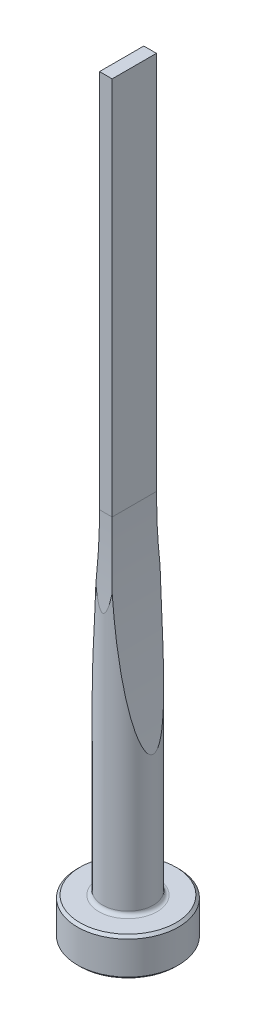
ISO-10303-21;
HEADER;
FILE_DESCRIPTION(('STEP AP214'),'2;1');
FILE_NAME('part.step','',(''),(''),'','','');
FILE_SCHEMA(('AUTOMOTIVE_DESIGN { 1 0 10303 214 1 1 1 1 }'));
ENDSEC;
DATA;
#1=APPLICATION_CONTEXT('core data for automotive mechanical design processes');
#2=APPLICATION_PROTOCOL_DEFINITION('international standard','automotive_design',2000,#1);
#3=PRODUCT_CONTEXT('',#1,'mechanical');
#4=PRODUCT('Part','Part','',(#3));
#5=PRODUCT_RELATED_PRODUCT_CATEGORY('part','',(#4));
#6=PRODUCT_DEFINITION_FORMATION('','',#4);
#7=PRODUCT_DEFINITION_CONTEXT('part definition',#1,'design');
#8=PRODUCT_DEFINITION('design','',#6,#7);
#9=PRODUCT_DEFINITION_SHAPE('','',#8);
#10=(LENGTH_UNIT() NAMED_UNIT(*) SI_UNIT(.MILLI.,.METRE.));
#11=(NAMED_UNIT(*) PLANE_ANGLE_UNIT() SI_UNIT($,.RADIAN.));
#12=(NAMED_UNIT(*) SI_UNIT($,.STERADIAN.) SOLID_ANGLE_UNIT());
#13=UNCERTAINTY_MEASURE_WITH_UNIT(LENGTH_MEASURE(1.E-05),#10,'distance_accuracy_value','');
#14=(GEOMETRIC_REPRESENTATION_CONTEXT(3) GLOBAL_UNCERTAINTY_ASSIGNED_CONTEXT((#13)) GLOBAL_UNIT_ASSIGNED_CONTEXT((#10,
#11,#12)) REPRESENTATION_CONTEXT('',''));
#15=CARTESIAN_POINT('',(0.,0.,0.));
#16=DIRECTION('',(0.,0.,1.));
#17=DIRECTION('',(1.,0.,0.));
#18=AXIS2_PLACEMENT_3D('',#15,#16,#17);
#19=CARTESIAN_POINT('',(0.,0.,0.));
#20=DIRECTION('',(0.,1.,0.));
#21=DIRECTION('',(-1.,0.,0.));
#22=AXIS2_PLACEMENT_3D('',#19,#20,#21);
#23=PLANE('',#22);
#24=CARTESIAN_POINT('',(0.,0.,0.));
#25=DIRECTION('',(0.,1.,0.));
#26=DIRECTION('',(-1.,0.,0.));
#27=AXIS2_PLACEMENT_3D('',#24,#25,#26);
#28=CIRCLE('',#27,3.8);
#29=CARTESIAN_POINT('',(-3.8,0.,0.));
#30=VERTEX_POINT('',#29);
#31=EDGE_CURVE('E133',#30,#30,#28,.T.);
#32=ORIENTED_EDGE('',*,*,#31,.F.);
#33=EDGE_LOOP('',(#32));
#34=FACE_BOUND('',#33,.T.);
#35=ADVANCED_FACE('F32',(#34),#23,.F.);
#36=CARTESIAN_POINT('',(0.,0.,0.));
#37=DIRECTION('',(0.,1.,0.));
#38=DIRECTION('',(-1.,0.,0.));
#39=AXIS2_PLACEMENT_3D('',#36,#37,#38);
#40=CONICAL_SURFACE('',#39,3.8,0.785398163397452);
#41=CARTESIAN_POINT('',(0.,0.199999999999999,0.));
#42=DIRECTION('',(0.,1.,0.));
#43=DIRECTION('',(-1.,0.,0.));
#44=AXIS2_PLACEMENT_3D('',#41,#42,#43);
#45=CIRCLE('',#44,4.);
#46=CARTESIAN_POINT('',(-4.,0.2,0.));
#47=VERTEX_POINT('',#46);
#48=EDGE_CURVE('E130',#47,#47,#45,.T.);
#49=ORIENTED_EDGE('',*,*,#48,.F.);
#50=EDGE_LOOP('',(#49));
#51=FACE_BOUND('',#50,.T.);
#52=ORIENTED_EDGE('',*,*,#31,.T.);
#53=EDGE_LOOP('',(#52));
#54=FACE_BOUND('',#53,.T.);
#55=ADVANCED_FACE('F171',(#51,#54),#40,.T.);
#56=CARTESIAN_POINT('',(0.,60.,0.));
#57=DIRECTION('',(0.,1.,0.));
#58=DIRECTION('',(-1.,0.,0.));
#59=AXIS2_PLACEMENT_3D('',#56,#57,#58);
#60=CYLINDRICAL_SURFACE('',#59,4.);
#61=CARTESIAN_POINT('',(0.,2.8,0.));
#62=DIRECTION('',(0.,1.,0.));
#63=DIRECTION('',(-1.,0.,0.));
#64=AXIS2_PLACEMENT_3D('',#61,#62,#63);
#65=CIRCLE('',#64,4.);
#66=CARTESIAN_POINT('',(-4.,2.8,0.));
#67=VERTEX_POINT('',#66);
#68=EDGE_CURVE('E127',#67,#67,#65,.T.);
#69=ORIENTED_EDGE('',*,*,#68,.F.);
#70=EDGE_LOOP('',(#69));
#71=FACE_BOUND('',#70,.T.);
#72=ORIENTED_EDGE('',*,*,#48,.T.);
#73=EDGE_LOOP('',(#72));
#74=FACE_BOUND('',#73,.T.);
#75=ADVANCED_FACE('F176',(#71,#74),#60,.T.);
#76=CARTESIAN_POINT('',(0.,2.8,0.));
#77=DIRECTION('',(0.,-1.,0.));
#78=DIRECTION('',(1.,0.,0.));
#79=AXIS2_PLACEMENT_3D('',#76,#77,#78);
#80=CONICAL_SURFACE('',#79,4.,0.785398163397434);
#81=CARTESIAN_POINT('',(0.,3.,0.));
#82=DIRECTION('',(0.,1.,0.));
#83=DIRECTION('',(-1.,0.,0.));
#84=AXIS2_PLACEMENT_3D('',#81,#82,#83);
#85=CIRCLE('',#84,3.8);
#86=CARTESIAN_POINT('',(-3.8,3.,0.));
#87=VERTEX_POINT('',#86);
#88=EDGE_CURVE('E124',#87,#87,#85,.T.);
#89=ORIENTED_EDGE('',*,*,#88,.F.);
#90=EDGE_LOOP('',(#89));
#91=FACE_BOUND('',#90,.T.);
#92=ORIENTED_EDGE('',*,*,#68,.T.);
#93=EDGE_LOOP('',(#92));
#94=FACE_BOUND('',#93,.T.);
#95=ADVANCED_FACE('F183',(#91,#94),#80,.T.);
#96=CARTESIAN_POINT('',(3.8,3.,0.));
#97=DIRECTION('',(0.,-1.,0.));
#98=DIRECTION('',(1.,0.,0.));
#99=AXIS2_PLACEMENT_3D('',#96,#97,#98);
#100=PLANE('',#99);
#101=CARTESIAN_POINT('',(0.,3.,0.));
#102=DIRECTION('',(0.,1.,0.));
#103=DIRECTION('',(-1.,0.,0.));
#104=AXIS2_PLACEMENT_3D('',#101,#102,#103);
#105=CIRCLE('',#104,2.30000000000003);
#106=CARTESIAN_POINT('',(-2.30000000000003,3.,0.));
#107=VERTEX_POINT('',#106);
#108=EDGE_CURVE('E121',#107,#107,#105,.T.);
#109=ORIENTED_EDGE('',*,*,#108,.F.);
#110=EDGE_LOOP('',(#109));
#111=FACE_BOUND('',#110,.T.);
#112=ORIENTED_EDGE('',*,*,#88,.T.);
#113=EDGE_LOOP('',(#112));
#114=FACE_BOUND('',#113,.T.);
#115=ADVANCED_FACE('F190',(#111,#114),#100,.F.);
#116=CARTESIAN_POINT('',(0.,3.3,0.));
#117=DIRECTION('',(0.,1.,0.));
#118=DIRECTION('',(-1.,0.,0.));
#119=AXIS2_PLACEMENT_3D('',#116,#117,#118);
#120=TOROIDAL_SURFACE('',#119,2.30000000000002,0.3);
#121=CARTESIAN_POINT('',(0.,3.3,0.));
#122=DIRECTION('',(0.,1.,0.));
#123=DIRECTION('',(-1.,0.,0.));
#124=AXIS2_PLACEMENT_3D('',#121,#122,#123);
#125=CIRCLE('',#124,2.00000000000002);
#126=CARTESIAN_POINT('',(-2.00000000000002,3.3,0.));
#127=VERTEX_POINT('',#126);
#128=EDGE_CURVE('E112',#127,#127,#125,.T.);
#129=ORIENTED_EDGE('',*,*,#128,.F.);
#130=EDGE_LOOP('',(#129));
#131=FACE_BOUND('',#130,.T.);
#132=ORIENTED_EDGE('',*,*,#108,.T.);
#133=EDGE_LOOP('',(#132));
#134=FACE_BOUND('',#133,.T.);
#135=ADVANCED_FACE('F168',(#131,#134),#120,.F.);
#136=CARTESIAN_POINT('',(0.,60.,0.));
#137=DIRECTION('',(0.,1.,0.));
#138=DIRECTION('',(-1.,0.,0.));
#139=AXIS2_PLACEMENT_3D('',#136,#137,#138);
#140=CYLINDRICAL_SURFACE('',#139,2.00000000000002);
#141=CARTESIAN_POINT('',(2.00000000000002,13.6369318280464,0.));
#142=CARTESIAN_POINT('',(1.99999959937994,13.6369339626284,0.0223459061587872));
#143=CARTESIAN_POINT('',(1.99962083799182,13.6389821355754,0.0447004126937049));
#144=CARTESIAN_POINT('',(1.99815425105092,13.6469172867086,0.0886950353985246));
#145=CARTESIAN_POINT('',(1.9970654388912,13.6528096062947,0.110334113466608));
#146=CARTESIAN_POINT('',(1.9938912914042,13.6700025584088,0.158557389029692));
#147=CARTESIAN_POINT('',(1.99160771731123,13.6823805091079,0.184738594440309));
#148=CARTESIAN_POINT('',(1.98633144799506,13.7110254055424,0.234784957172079));
#149=CARTESIAN_POINT('',(1.98333711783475,13.7273013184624,0.258644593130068));
#150=CARTESIAN_POINT('',(1.9743629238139,13.7761726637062,0.321817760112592));
#151=CARTESIAN_POINT('',(1.96786628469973,13.8116478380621,0.358796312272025));
#152=CARTESIAN_POINT('',(1.95408957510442,13.8871713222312,0.427500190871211));
#153=CARTESIAN_POINT('',(1.94680713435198,13.92723349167,0.459208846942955));
#154=CARTESIAN_POINT('',(1.92754936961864,14.0336190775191,0.535616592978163));
#155=CARTESIAN_POINT('',(1.91526044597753,14.101920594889,0.577448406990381));
#156=CARTESIAN_POINT('',(1.89023046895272,14.2420223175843,0.654719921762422));
#157=CARTESIAN_POINT('',(1.87748839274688,14.3138305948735,0.69014389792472));
#158=CARTESIAN_POINT('',(1.85175370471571,14.4599241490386,0.756491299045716));
#159=CARTESIAN_POINT('',(1.83876009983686,14.5342208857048,0.787388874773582));
#160=CARTESIAN_POINT('',(1.81274809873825,14.6840888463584,0.84554954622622));
#161=CARTESIAN_POINT('',(1.79972975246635,14.7596583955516,0.872817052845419));
#162=CARTESIAN_POINT('',(1.77256783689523,14.9185595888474,0.926820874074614));
#163=CARTESIAN_POINT('',(1.75842768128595,15.0019813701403,0.953291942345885));
#164=CARTESIAN_POINT('',(1.73025157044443,15.1696595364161,1.00352104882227));
#165=CARTESIAN_POINT('',(1.71621563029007,15.2539160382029,1.02727870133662));
#166=CARTESIAN_POINT('',(1.67431249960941,15.5077044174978,1.09523119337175));
#167=CARTESIAN_POINT('',(1.64666477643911,15.6781687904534,1.13607747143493));
#168=CARTESIAN_POINT('',(1.59207672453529,16.021036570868,1.21137932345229));
#169=CARTESIAN_POINT('',(1.56513835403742,16.1934437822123,1.24581853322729));
#170=CARTESIAN_POINT('',(1.5121402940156,16.5392639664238,1.30963761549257));
#171=CARTESIAN_POINT('',(1.48608034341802,16.7126766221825,1.33901900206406));
#172=CARTESIAN_POINT('',(1.43486714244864,17.0604086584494,1.39375720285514));
#173=CARTESIAN_POINT('',(1.40971464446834,17.2347286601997,1.41911073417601));
#174=CARTESIAN_POINT('',(1.36037231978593,17.5839667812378,1.46647728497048));
#175=CARTESIAN_POINT('',(1.3361825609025,17.7588849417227,1.48849006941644));
#176=CARTESIAN_POINT('',(1.28882757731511,18.1089168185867,1.52967523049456));
#177=CARTESIAN_POINT('',(1.26566085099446,18.2840298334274,1.54885187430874));
#178=CARTESIAN_POINT('',(1.22032996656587,18.6346243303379,1.58481206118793));
#179=CARTESIAN_POINT('',(1.19816578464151,18.810105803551,1.60159566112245));
#180=CARTESIAN_POINT('',(1.13349124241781,19.3346050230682,1.64864861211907));
#181=CARTESIAN_POINT('',(1.09247383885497,19.6840801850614,1.67589262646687));
#182=CARTESIAN_POINT('',(1.01449864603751,20.3839177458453,1.72420545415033));
#183=CARTESIAN_POINT('',(0.977541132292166,20.7342802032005,1.74527384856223));
#184=CARTESIAN_POINT('',(0.907713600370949,21.4357442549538,1.78258876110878));
#185=CARTESIAN_POINT('',(0.874844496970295,21.7868459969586,1.79883420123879));
#186=CARTESIAN_POINT('',(0.813223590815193,22.4895706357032,1.82751742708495));
#187=CARTESIAN_POINT('',(0.78447188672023,22.841193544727,1.83995512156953));
#188=CARTESIAN_POINT('',(0.731059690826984,23.545372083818,1.86182337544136));
#189=CARTESIAN_POINT('',(0.706405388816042,23.8979283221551,1.87124940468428));
#190=CARTESIAN_POINT('',(0.661248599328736,24.6033645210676,1.88767631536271));
#191=CARTESIAN_POINT('',(0.640746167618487,24.9562444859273,1.89467716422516));
#192=CARTESIAN_POINT('',(0.585481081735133,26.0151631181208,1.91278651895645));
#193=CARTESIAN_POINT('',(0.556952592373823,26.7215865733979,1.9210048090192));
#194=CARTESIAN_POINT('',(0.516517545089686,28.1360547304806,1.93226157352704));
#195=CARTESIAN_POINT('',(0.504637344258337,28.8441002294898,1.93529183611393));
#196=CARTESIAN_POINT('',(0.497590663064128,30.2603118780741,1.93711555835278));
#197=CARTESIAN_POINT('',(0.502424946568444,30.9684780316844,1.9359088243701));
#198=CARTESIAN_POINT('',(0.528792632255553,32.3837383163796,1.92887969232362));
#199=CARTESIAN_POINT('',(0.550308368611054,33.0908327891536,1.92306217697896));
#200=CARTESIAN_POINT('',(0.595075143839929,34.150851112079,1.90947934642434));
#201=CARTESIAN_POINT('',(0.612079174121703,34.5040802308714,1.90414245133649));
#202=CARTESIAN_POINT('',(0.650247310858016,35.2102761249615,1.89145128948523));
#203=CARTESIAN_POINT('',(0.671411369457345,35.5632429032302,1.88409704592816));
#204=CARTESIAN_POINT('',(0.717844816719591,36.26810136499,1.86689845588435));
#205=CARTESIAN_POINT('',(0.743105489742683,36.6199937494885,1.85705937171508));
#206=CARTESIAN_POINT('',(0.797754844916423,37.3233627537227,1.8342479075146));
#207=CARTESIAN_POINT('',(0.827143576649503,37.6748393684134,1.82127548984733));
#208=CARTESIAN_POINT('',(0.890074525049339,38.3777029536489,1.79136371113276));
#209=CARTESIAN_POINT('',(0.923621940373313,38.7290892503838,1.77441936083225));
#210=CARTESIAN_POINT('',(0.994816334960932,39.4311489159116,1.73550864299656));
#211=CARTESIAN_POINT('',(1.03246301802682,39.7818223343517,1.71354263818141));
#212=CARTESIAN_POINT('',(1.11158826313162,40.4802015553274,1.66329673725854));
#213=CARTESIAN_POINT('',(1.15304311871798,40.8279127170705,1.63505453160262));
#214=CARTESIAN_POINT('',(1.23992287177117,41.5221969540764,1.57020891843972));
#215=CARTESIAN_POINT('',(1.28534897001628,41.8687696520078,1.53360297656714));
#216=CARTESIAN_POINT('',(1.35631554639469,42.3868414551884,1.4701694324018));
#217=CARTESIAN_POINT('',(1.3804170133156,42.5590642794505,1.44763070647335));
#218=CARTESIAN_POINT('',(1.42954752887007,42.9028929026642,1.39913926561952));
#219=CARTESIAN_POINT('',(1.45457653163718,43.0744987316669,1.37318671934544));
#220=CARTESIAN_POINT('',(1.50551075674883,43.4168108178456,1.31714471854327));
#221=CARTESIAN_POINT('',(1.53141549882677,43.5875175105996,1.28705750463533));
#222=CARTESIAN_POINT('',(1.5840506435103,43.9277984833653,1.22170129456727));
#223=CARTESIAN_POINT('',(1.61078090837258,44.0973729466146,1.18643315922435));
#224=CARTESIAN_POINT('',(1.65397046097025,44.3663968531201,1.12479455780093));
#225=CARTESIAN_POINT('',(1.67019715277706,44.4663857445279,1.1006190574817));
#226=CARTESIAN_POINT('',(1.70287155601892,44.6656117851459,1.04935942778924));
#227=CARTESIAN_POINT('',(1.71931932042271,44.7648487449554,1.0222745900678));
#228=CARTESIAN_POINT('',(1.75239134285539,44.9623523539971,0.964487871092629));
#229=CARTESIAN_POINT('',(1.76901575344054,45.0606179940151,0.933782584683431));
#230=CARTESIAN_POINT('',(1.80232271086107,45.2555503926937,0.867756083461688));
#231=CARTESIAN_POINT('',(1.81900523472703,45.3522177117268,0.832436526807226));
#232=CARTESIAN_POINT('',(1.85233564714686,45.5435207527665,0.755409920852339));
#233=CARTESIAN_POINT('',(1.86898314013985,45.6381469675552,0.713678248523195));
#234=CARTESIAN_POINT('',(1.89355523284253,45.7765692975,0.644235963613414));
#235=CARTESIAN_POINT('',(1.90166612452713,45.8220505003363,0.619994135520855));
#236=CARTESIAN_POINT('',(1.91766149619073,45.9113598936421,0.568591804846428));
#237=CARTESIAN_POINT('',(1.92554594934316,45.9551878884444,0.541430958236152));
#238=CARTESIAN_POINT('',(1.94445150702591,46.0598482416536,0.470167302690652));
#239=CARTESIAN_POINT('',(1.95527858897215,46.1194068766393,0.423957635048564));
#240=CARTESIAN_POINT('',(1.97014146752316,46.2007698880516,0.34532576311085));
#241=CARTESIAN_POINT('',(1.97489054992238,46.2266935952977,0.317364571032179));
#242=CARTESIAN_POINT('',(1.98356316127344,46.2739354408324,0.257652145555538));
#243=CARTESIAN_POINT('',(1.98748960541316,46.2952698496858,0.225914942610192));
#244=CARTESIAN_POINT('',(1.99266849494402,46.3233693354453,0.172252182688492));
#245=CARTESIAN_POINT('',(1.99435746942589,46.3325227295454,0.151632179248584));
#246=CARTESIAN_POINT('',(1.99713028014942,46.3475413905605,0.109184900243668));
#247=CARTESIAN_POINT('',(1.99821491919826,46.3534110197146,0.0873592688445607));
#248=CARTESIAN_POINT('',(1.99966711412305,46.361268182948,0.0427916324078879));
#249=CARTESIAN_POINT('',(2.00002878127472,46.3632238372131,0.0200436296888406));
#250=CARTESIAN_POINT('',(1.99996760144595,46.3628929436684,-0.0254230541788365));
#251=CARTESIAN_POINT('',(1.99954467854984,46.3606059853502,-0.048141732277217));
#252=CARTESIAN_POINT('',(1.9980429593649,46.3524803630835,-0.0907709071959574));
#253=CARTESIAN_POINT('',(1.99702639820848,46.3469786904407,-0.110750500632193));
#254=CARTESIAN_POINT('',(1.99448592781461,46.3332185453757,-0.149690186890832));
#255=CARTESIAN_POINT('',(1.99296174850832,46.324958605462,-0.16864973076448));
#256=CARTESIAN_POINT('',(1.98831296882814,46.2997396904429,-0.218154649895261));
#257=CARTESIAN_POINT('',(1.98481178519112,46.2807219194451,-0.247608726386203));
#258=CARTESIAN_POINT('',(1.97706913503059,46.2385707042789,-0.303299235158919));
#259=CARTESIAN_POINT('',(1.97282513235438,46.2154231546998,-0.329524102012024));
#260=CARTESIAN_POINT('',(1.95935725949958,46.1417794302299,-0.404383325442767));
#261=CARTESIAN_POINT('',(1.94943417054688,46.0872801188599,-0.448889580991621));
#262=CARTESIAN_POINT('',(1.92879683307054,45.9732711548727,-0.530561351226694));
#263=CARTESIAN_POINT('',(1.91808016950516,45.9137461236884,-0.567703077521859));
#264=CARTESIAN_POINT('',(1.89724400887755,45.7973037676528,-0.633676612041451));
#265=CARTESIAN_POINT('',(1.88715715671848,45.740631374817,-0.662954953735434));
#266=CARTESIAN_POINT('',(1.86682157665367,45.6257191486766,-0.718219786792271));
#267=CARTESIAN_POINT('',(1.85657275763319,45.5674784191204,-0.744204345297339));
#268=CARTESIAN_POINT('',(1.82568757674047,45.3909251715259,-0.818391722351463));
#269=CARTESIAN_POINT('',(1.80495249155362,45.2710047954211,-0.862710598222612));
#270=CARTESIAN_POINT('',(1.76350002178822,45.0282684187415,-0.944537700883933));
#271=CARTESIAN_POINT('',(1.74278323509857,44.9054410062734,-0.982011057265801));
#272=CARTESIAN_POINT('',(1.70165653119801,44.6584394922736,-1.05166411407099));
#273=CARTESIAN_POINT('',(1.68124623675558,44.5342674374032,-1.08385090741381));
#274=CARTESIAN_POINT('',(1.64101494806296,44.2862310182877,-1.14383417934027));
#275=CARTESIAN_POINT('',(1.62118998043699,44.1623776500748,-1.17167406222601));
#276=CARTESIAN_POINT('',(1.58195540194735,43.9139199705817,-1.22412636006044));
#277=CARTESIAN_POINT('',(1.56254582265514,43.7893156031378,-1.24873853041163));
#278=CARTESIAN_POINT('',(1.50498233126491,43.4145704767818,-1.31859618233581));
#279=CARTESIAN_POINT('',(1.46750707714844,43.1635803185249,-1.3598437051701));
#280=CARTESIAN_POINT('',(1.39446681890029,42.6597358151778,-1.43463394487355));
#281=CARTESIAN_POINT('',(1.35890544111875,42.4068788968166,-1.46816240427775));
#282=CARTESIAN_POINT('',(1.28985321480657,41.9002128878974,-1.52918268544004));
#283=CARTESIAN_POINT('',(1.25636197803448,41.6464039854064,-1.55667564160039));
#284=CARTESIAN_POINT('',(1.19153191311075,41.1383585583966,-1.60683751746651));
#285=CARTESIAN_POINT('',(1.16019052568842,40.88412292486,-1.6295122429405));
#286=CARTESIAN_POINT('',(1.0996445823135,40.3750740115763,-1.67096428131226));
#287=CARTESIAN_POINT('',(1.07044011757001,40.1202607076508,-1.68974142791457));
#288=CARTESIAN_POINT('',(0.986119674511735,39.3556408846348,-1.74124672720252));
#289=CARTESIAN_POINT('',(0.93423266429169,38.8451532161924,-1.7691952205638));
#290=CARTESIAN_POINT('',(0.839538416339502,37.8269457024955,-1.81601562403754));
#291=CARTESIAN_POINT('',(0.796663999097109,37.3192350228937,-1.83495612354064));
#292=CARTESIAN_POINT('',(0.719531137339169,36.3029451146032,-1.86655063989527));
#293=CARTESIAN_POINT('',(0.685273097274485,35.7943658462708,-1.87920436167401));
#294=CARTESIAN_POINT('',(0.625385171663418,34.7763705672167,-1.89997212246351));
#295=CARTESIAN_POINT('',(0.599759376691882,34.2669542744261,-1.90808401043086));
#296=CARTESIAN_POINT('',(0.557171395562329,33.2477280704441,-1.92095127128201));
#297=CARTESIAN_POINT('',(0.540209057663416,32.7379181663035,-1.92570670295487));
#298=CARTESIAN_POINT('',(0.514960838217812,31.718326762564,-1.93261112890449));
#299=CARTESIAN_POINT('',(0.506670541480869,31.2085453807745,-1.93476144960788));
#300=CARTESIAN_POINT('',(0.498754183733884,30.1889064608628,-1.93681718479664));
#301=CARTESIAN_POINT('',(0.499128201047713,29.6790489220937,-1.93672257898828));
#302=CARTESIAN_POINT('',(0.508539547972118,28.6595267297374,-1.93427286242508));
#303=CARTESIAN_POINT('',(0.517575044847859,28.1498620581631,-1.93191822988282));
#304=CARTESIAN_POINT('',(0.544302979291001,27.1307884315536,-1.9245587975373));
#305=CARTESIAN_POINT('',(0.561995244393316,26.6213794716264,-1.91955405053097));
#306=CARTESIAN_POINT('',(0.606629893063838,25.5890885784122,-1.90592838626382));
#307=CARTESIAN_POINT('',(0.633811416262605,25.0662181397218,-1.89721255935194));
#308=CARTESIAN_POINT('',(0.697287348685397,24.0211319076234,-1.87481290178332));
#309=CARTESIAN_POINT('',(0.733581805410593,23.498916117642,-1.86112904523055));
#310=CARTESIAN_POINT('',(0.815237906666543,22.4556613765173,-1.82684566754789));
#311=CARTESIAN_POINT('',(0.860595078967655,21.934621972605,-1.80624955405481));
#312=CARTESIAN_POINT('',(0.935398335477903,21.1540708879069,-1.76799386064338));
#313=CARTESIAN_POINT('',(0.961461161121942,20.894050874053,-1.75401474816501));
#314=CARTESIAN_POINT('',(1.0158309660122,20.374423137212,-1.72309839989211));
#315=CARTESIAN_POINT('',(1.04413791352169,20.1148154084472,-1.70616120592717));
#316=CARTESIAN_POINT('',(1.1132929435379,19.5051986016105,-1.66216858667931));
#317=CARTESIAN_POINT('',(1.15505916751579,19.1553968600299,-1.63364746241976));
#318=CARTESIAN_POINT('',(1.24258843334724,18.4571129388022,-1.56811548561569));
#319=CARTESIAN_POINT('',(1.28835090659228,18.1086305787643,-1.53110583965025));
#320=CARTESIAN_POINT('',(1.36851706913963,17.5245931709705,-1.45912605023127));
#321=CARTESIAN_POINT('',(1.40188146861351,17.2885124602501,-1.42727858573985));
#322=CARTESIAN_POINT('',(1.47033119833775,16.8176392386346,-1.35667442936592));
#323=CARTESIAN_POINT('',(1.50541631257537,16.5828465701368,-1.31791860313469));
#324=CARTESIAN_POINT('',(1.56586956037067,16.1888918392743,-1.24480040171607));
#325=CARTESIAN_POINT('',(1.59081615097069,16.0292096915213,-1.21290136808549));
#326=CARTESIAN_POINT('',(1.64138444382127,15.711110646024,-1.14355345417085));
#327=CARTESIAN_POINT('',(1.66700624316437,15.55269393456,-1.10610377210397));
#328=CARTESIAN_POINT('',(1.71077059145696,15.2865745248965,-1.03652475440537));
#329=CARTESIAN_POINT('',(1.72877472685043,15.1783445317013,-1.00633379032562));
#330=CARTESIAN_POINT('',(1.76494280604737,14.9633285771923,-0.941469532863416));
#331=CARTESIAN_POINT('',(1.7831066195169,14.8565415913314,-0.906799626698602));
#332=CARTESIAN_POINT('',(1.81396089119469,14.6770737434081,-0.842848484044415));
#333=CARTESIAN_POINT('',(1.82664500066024,14.6038471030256,-0.815109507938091));
#334=CARTESIAN_POINT('',(1.85195768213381,14.4587636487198,-0.755839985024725));
#335=CARTESIAN_POINT('',(1.86458610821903,14.3869096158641,-0.724302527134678));
#336=CARTESIAN_POINT('',(1.89040343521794,14.2410282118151,-0.654124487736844));
#337=CARTESIAN_POINT('',(1.90357788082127,14.1671467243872,-0.615162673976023));
#338=CARTESIAN_POINT('',(1.92281794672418,14.0599829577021,-0.550693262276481));
#339=CARTESIAN_POINT('',(1.92913565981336,14.0249192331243,-0.528235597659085));
#340=CARTESIAN_POINT('',(1.94150282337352,13.9565035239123,-0.480802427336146));
#341=CARTESIAN_POINT('',(1.94755251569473,13.9231499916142,-0.455829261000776));
#342=CARTESIAN_POINT('',(1.95806876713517,13.865344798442,-0.407971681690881));
#343=CARTESIAN_POINT('',(1.96261120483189,13.8404403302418,-0.385656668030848));
#344=CARTESIAN_POINT('',(1.97129564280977,13.7929309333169,-0.338482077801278));
#345=CARTESIAN_POINT('',(1.9754367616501,13.7703310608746,-0.313617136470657));
#346=CARTESIAN_POINT('',(1.98314721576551,13.728330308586,-0.260502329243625));
#347=CARTESIAN_POINT('',(1.98670628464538,13.7089867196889,-0.232204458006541));
#348=CARTESIAN_POINT('',(1.99278059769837,13.6760177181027,-0.172374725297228));
#349=CARTESIAN_POINT('',(1.99530171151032,13.6623601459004,-0.140862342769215));
#350=CARTESIAN_POINT('',(1.99802431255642,13.6476201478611,-0.090602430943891));
#351=CARTESIAN_POINT('',(1.99875930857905,13.6436433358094,-0.0727259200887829));
#352=CARTESIAN_POINT('',(1.99974726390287,13.6382985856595,-0.0365681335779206));
#353=CARTESIAN_POINT('',(2.00000032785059,13.6369300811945,-0.018286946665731));
#354=CARTESIAN_POINT('',(2.00000000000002,13.6369318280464,0.));
#355=B_SPLINE_CURVE_WITH_KNOTS('',3,(#141,#142,#143,#144,#145,#146,#147,#148,#149,#150,#151,
#152,#153,#154,#155,#156,#157,#158,#159,#160,#161,#162,#163,#164,#165,#166,#167,#168,#169,#170,
#171,#172,#173,#174,#175,#176,#177,#178,#179,#180,#181,#182,#183,#184,#185,#186,#187,#188,#189,
#190,#191,#192,#193,#194,#195,#196,#197,#198,#199,#200,#201,#202,#203,#204,#205,#206,#207,#208,
#209,#210,#211,#212,#213,#214,#215,#216,#217,#218,#219,#220,#221,#222,#223,#224,#225,#226,#227,
#228,#229,#230,#231,#232,#233,#234,#235,#236,#237,#238,#239,#240,#241,#242,#243,#244,#245,#246,
#247,#248,#249,#250,#251,#252,#253,#254,#255,#256,#257,#258,#259,#260,#261,#262,#263,#264,#265,
#266,#267,#268,#269,#270,#271,#272,#273,#274,#275,#276,#277,#278,#279,#280,#281,#282,#283,#284,
#285,#286,#287,#288,#289,#290,#291,#292,#293,#294,#295,#296,#297,#298,#299,#300,#301,#302,#303,
#304,#305,#306,#307,#308,#309,#310,#311,#312,#313,#314,#315,#316,#317,#318,#319,#320,#321,#322,
#323,#324,#325,#326,#327,#328,#329,#330,#331,#332,#333,#334,#335,#336,#337,#338,#339,#340,#341,
#342,#343,#344,#345,#346,#347,#348,#349,#350,#351,#352,#353,#354),.UNSPECIFIED.,.T.,.F.,(4,2,2,
2,2,2,2,2,2,2,2,2,2,2,2,2,2,2,2,2,2,2,2,2,2,2,2,2,2,2,2,2,2,2,2,2,2,2,2,2,2,2,2,2,2,2,2,2,2,2,2,
2,2,2,2,2,2,2,2,2,2,2,2,2,2,2,2,2,2,2,2,2,2,2,2,2,2,2,2,2,2,2,2,2,2,2,2,2,2,2,2,2,2,2,2,2,2,2,2,
2,2,2,2,2,2,2,4),(0.,0.0669624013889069,0.134018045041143,0.220670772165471,0.307524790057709,
0.461614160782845,0.616182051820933,0.858650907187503,1.10170693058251,1.34610098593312,
1.59019531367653,1.85610381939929,2.12205007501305,2.65421827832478,3.18772756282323,
3.72107686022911,4.25485865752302,4.78867798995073,5.3216857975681,5.85468093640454,
6.91335433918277,7.97209954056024,9.03108120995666,10.0900882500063,11.150680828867,
12.2112876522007,14.3321822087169,16.456430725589,18.5807763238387,20.7028752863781,
21.7638861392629,22.8248847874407,23.8836550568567,24.9424380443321,26.0025581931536,
27.0626017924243,28.1164437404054,29.1706054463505,29.6966440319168,30.2226566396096,
30.7483853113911,31.2740267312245,31.5864186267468,31.8988867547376,32.2116511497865,
32.5243034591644,32.8381878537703,32.9946058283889,33.1510422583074,33.3782257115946,
33.4932147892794,33.607789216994,33.6754354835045,33.742991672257,33.8110959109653,
33.8792067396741,33.9412079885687,34.0032422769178,34.1083294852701,34.213782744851,
34.4257772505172,34.6384457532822,34.8320405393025,35.0257484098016,35.4139275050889,
35.8040319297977,36.1936086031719,36.5790049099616,36.9644304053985,37.735538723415,
38.5080600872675,39.2804361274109,40.0518761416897,40.8233490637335,42.3647732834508,
43.8942649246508,45.4238283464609,46.9541155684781,48.4843759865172,50.0138569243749,
51.5433516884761,53.0725228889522,54.6016636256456,56.1725124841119,57.7433695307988,
59.3134533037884,60.0985213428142,60.8835782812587,61.9437988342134,63.0038687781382,
63.7254256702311,64.446892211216,64.9410344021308,65.4352480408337,65.7765660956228,
66.1176275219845,66.3555218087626,66.5938556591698,66.8471216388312,66.9733921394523,
67.0995462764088,67.2006585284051,67.3019880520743,67.4049471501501,67.5073157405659,
67.5621268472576,67.6169260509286),.UNSPECIFIED.);
#356=CARTESIAN_POINT('',(0.643611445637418,24.9177331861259,-1.89361144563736));
#357=VERTEX_POINT('',#356);
#358=CARTESIAN_POINT('',(0.643611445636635,24.917733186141,1.89361144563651));
#359=VERTEX_POINT('',#358);
#360=EDGE_CURVE('E138',#357,#359,#355,.T.);
#361=ORIENTED_EDGE('',*,*,#360,.T.);
#362=CARTESIAN_POINT('',(-0.968245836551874,30.,1.75));
#363=CARTESIAN_POINT('',(-0.968238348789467,30.3335504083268,1.74999985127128));
#364=CARTESIAN_POINT('',(-0.964913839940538,30.6670930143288,1.75185441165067));
#365=CARTESIAN_POINT('',(-0.951335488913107,31.3339943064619,1.75926912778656));
#366=CARTESIAN_POINT('',(-0.941081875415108,31.6673529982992,1.76482916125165));
#367=CARTESIAN_POINT('',(-0.912720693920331,32.3344915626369,1.77966177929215));
#368=CARTESIAN_POINT('',(-0.89459357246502,32.6682704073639,1.78894360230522));
#369=CARTESIAN_POINT('',(-0.848686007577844,33.3349608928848,1.81119198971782));
#370=CARTESIAN_POINT('',(-0.820909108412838,33.6678728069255,1.82415720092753));
#371=CARTESIAN_POINT('',(-0.769005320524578,34.1665035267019,1.84634021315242));
#372=CARTESIAN_POINT('',(-0.749965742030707,34.3328098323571,1.85420260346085));
#373=CARTESIAN_POINT('',(-0.707487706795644,34.6649255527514,1.87082483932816));
#374=CARTESIAN_POINT('',(-0.684046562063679,34.8307346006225,1.87958523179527));
#375=CARTESIAN_POINT('',(-0.631397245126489,35.1606520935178,1.8979281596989));
#376=CARTESIAN_POINT('',(-0.602215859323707,35.3247648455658,1.90750676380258));
#377=CARTESIAN_POINT('',(-0.551786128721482,35.5694473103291,1.92245449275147));
#378=CARTESIAN_POINT('',(-0.533878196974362,35.6507164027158,1.92753077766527));
#379=CARTESIAN_POINT('',(-0.495093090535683,35.8125239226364,1.93785640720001));
#380=CARTESIAN_POINT('',(-0.474216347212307,35.8930624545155,1.94310572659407));
#381=CARTESIAN_POINT('',(-0.428292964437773,36.0530757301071,1.95374902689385));
#382=CARTESIAN_POINT('',(-0.403242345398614,36.132549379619,1.9591431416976));
#383=CARTESIAN_POINT('',(-0.360560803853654,36.2502226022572,1.96728291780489));
#384=CARTESIAN_POINT('',(-0.345421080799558,36.2893239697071,1.97001385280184));
#385=CARTESIAN_POINT('',(-0.312809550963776,36.366532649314,1.97545600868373));
#386=CARTESIAN_POINT('',(-0.295340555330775,36.4046410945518,1.97816724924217));
#387=CARTESIAN_POINT('',(-0.256751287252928,36.4796372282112,1.98354888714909));
#388=CARTESIAN_POINT('',(-0.235581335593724,36.5164989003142,1.98621810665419));
#389=CARTESIAN_POINT('',(-0.187728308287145,36.586387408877,1.99131986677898));
#390=CARTESIAN_POINT('',(-0.161126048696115,36.6194604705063,1.99375518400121));
#391=CARTESIAN_POINT('',(-0.120751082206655,36.6547640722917,1.99636953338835));
#392=CARTESIAN_POINT('',(-0.111560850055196,36.6620369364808,1.9969091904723));
#393=CARTESIAN_POINT('',(-0.0922735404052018,36.6752894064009,1.9978938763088));
#394=CARTESIAN_POINT('',(-0.082177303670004,36.6812701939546,1.99833899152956));
#395=CARTESIAN_POINT('',(-0.0632207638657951,36.6903867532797,1.99901815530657));
#396=CARTESIAN_POINT('',(-0.054523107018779,36.6938532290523,1.99927668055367));
#397=CARTESIAN_POINT('',(-0.0366717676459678,36.6993072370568,1.99968362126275));
#398=CARTESIAN_POINT('',(-0.0275187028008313,36.7012967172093,1.99983218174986));
#399=CARTESIAN_POINT('',(-0.00893111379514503,36.7035672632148,2.0000017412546));
#400=CARTESIAN_POINT('',(0.000504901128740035,36.7038366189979,2.00002186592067));
#401=CARTESIAN_POINT('',(0.0192584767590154,36.7025973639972,1.99992930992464));
#402=CARTESIAN_POINT('',(0.0285759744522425,36.7010878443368,1.99981656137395));
#403=CARTESIAN_POINT('',(0.0479382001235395,36.6961998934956,1.99945173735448));
#404=CARTESIAN_POINT('',(0.0579283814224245,36.6926115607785,1.99918401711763));
#405=CARTESIAN_POINT('',(0.0771947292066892,36.6838760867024,1.99853304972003));
#406=CARTESIAN_POINT('',(0.0864694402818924,36.6787258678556,1.99814957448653));
#407=CARTESIAN_POINT('',(0.110056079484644,36.6635871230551,1.99702403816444));
#408=CARTESIAN_POINT('',(0.123732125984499,36.6526274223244,1.99621074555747));
#409=CARTESIAN_POINT('',(0.149379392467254,36.628892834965,1.99445462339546));
#410=CARTESIAN_POINT('',(0.161345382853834,36.616112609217,1.9935114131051));
#411=CARTESIAN_POINT('',(0.205772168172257,36.5638954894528,1.98967042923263));
#412=CARTESIAN_POINT('',(0.233384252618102,36.5204677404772,1.98650266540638));
#413=CARTESIAN_POINT('',(0.283063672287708,36.4305772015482,1.98001734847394));
#414=CARTESIAN_POINT('',(0.305089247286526,36.3840946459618,1.97669887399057));
#415=CARTESIAN_POINT('',(0.346614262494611,36.2871258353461,1.9698545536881));
#416=CARTESIAN_POINT('',(0.365923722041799,36.2365569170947,1.96632687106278));
#417=CARTESIAN_POINT('',(0.401868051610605,36.1344657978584,1.95929356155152));
#418=CARTESIAN_POINT('',(0.418500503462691,36.0829427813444,1.95578795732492));
#419=CARTESIAN_POINT('',(0.465545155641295,35.9272647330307,1.9453322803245));
#420=CARTESIAN_POINT('',(0.493020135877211,35.8222195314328,1.93845882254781));
#421=CARTESIAN_POINT('',(0.543128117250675,35.6109304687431,1.92501070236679));
#422=CARTESIAN_POINT('',(0.565757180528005,35.5046857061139,1.91843628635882));
#423=CARTESIAN_POINT('',(0.607474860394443,35.2916513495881,1.90563570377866));
#424=CARTESIAN_POINT('',(0.626568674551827,35.1848627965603,1.8994090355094));
#425=CARTESIAN_POINT('',(0.67960652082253,34.8655887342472,1.88136685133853));
#426=CARTESIAN_POINT('',(0.709688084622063,34.6524380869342,1.87007721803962));
#427=CARTESIAN_POINT('',(0.762936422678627,34.2251827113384,1.84897871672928));
#428=CARTESIAN_POINT('',(0.786101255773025,34.0110777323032,1.83917026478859));
#429=CARTESIAN_POINT('',(0.827204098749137,33.5820289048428,1.82105456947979));
#430=CARTESIAN_POINT('',(0.845135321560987,33.3670843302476,1.8127492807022));
#431=CARTESIAN_POINT('',(0.876742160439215,32.9368251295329,1.79767146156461));
#432=CARTESIAN_POINT('',(0.890417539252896,32.7215104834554,1.79089901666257));
#433=CARTESIAN_POINT('',(0.92604238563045,32.0754331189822,1.77290217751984));
#434=CARTESIAN_POINT('',(0.942611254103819,31.6443036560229,1.76398841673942));
#435=CARTESIAN_POINT('',(0.964025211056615,30.7819612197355,1.75236444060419));
#436=CARTESIAN_POINT('',(0.968877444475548,30.3507484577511,1.74965044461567));
#437=CARTESIAN_POINT('',(0.967552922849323,29.5308621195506,1.75038346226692));
#438=CARTESIAN_POINT('',(0.962416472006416,29.1421864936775,1.75324937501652));
#439=CARTESIAN_POINT('',(0.942544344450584,28.3650984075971,1.76401153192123));
#440=CARTESIAN_POINT('',(0.927807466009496,27.9766859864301,1.77190840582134));
#441=CARTESIAN_POINT('',(0.887028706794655,27.2013181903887,1.79269108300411));
#442=CARTESIAN_POINT('',(0.861009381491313,26.8143614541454,1.80556692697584));
#443=CARTESIAN_POINT('',(0.810327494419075,26.2349947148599,1.82857800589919));
#444=CARTESIAN_POINT('',(0.791485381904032,26.0420037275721,1.83686705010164));
#445=CARTESIAN_POINT('',(0.748852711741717,25.6566468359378,1.85465818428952));
#446=CARTESIAN_POINT('',(0.725062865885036,25.4642808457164,1.86416009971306));
#447=CARTESIAN_POINT('',(0.670881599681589,25.0804343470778,1.88435148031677));
#448=CARTESIAN_POINT('',(0.640488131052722,24.8889541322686,1.8950413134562));
#449=CARTESIAN_POINT('',(0.587350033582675,24.6032913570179,1.91189763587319));
#450=CARTESIAN_POINT('',(0.5683920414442,24.5083825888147,1.91764989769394));
#451=CARTESIAN_POINT('',(0.527121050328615,24.3193197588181,1.92940755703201));
#452=CARTESIAN_POINT('',(0.504809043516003,24.2251654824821,1.93541287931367));
#453=CARTESIAN_POINT('',(0.467684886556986,24.0847170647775,1.94459011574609));
#454=CARTESIAN_POINT('',(0.454672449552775,24.0379428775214,1.94768347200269));
#455=CARTESIAN_POINT('',(0.427105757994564,23.9448190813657,1.95391455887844));
#456=CARTESIAN_POINT('',(0.412550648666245,23.8984697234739,1.95705231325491));
#457=CARTESIAN_POINT('',(0.381456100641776,23.8064886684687,1.96334987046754));
#458=CARTESIAN_POINT('',(0.364918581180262,23.7608563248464,1.96650964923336));
#459=CARTESIAN_POINT('',(0.329109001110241,23.6706906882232,1.97282096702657));
#460=CARTESIAN_POINT('',(0.309839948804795,23.6261562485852,1.97597251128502));
#461=CARTESIAN_POINT('',(0.27187687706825,23.5487600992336,1.98150517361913));
#462=CARTESIAN_POINT('',(0.254001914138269,23.5154988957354,1.98390223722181));
#463=CARTESIAN_POINT('',(0.214436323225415,23.4511543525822,1.98857376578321));
#464=CARTESIAN_POINT('',(0.19274943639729,23.4200689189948,1.99084834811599));
#465=CARTESIAN_POINT('',(0.155344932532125,23.3773052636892,1.99399670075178));
#466=CARTESIAN_POINT('',(0.141972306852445,23.3636268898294,1.99500731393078));
#467=CARTESIAN_POINT('',(0.113107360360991,23.3387364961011,1.99685119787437));
#468=CARTESIAN_POINT('',(0.097630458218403,23.3275079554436,1.9976856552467));
#469=CARTESIAN_POINT('',(0.0728302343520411,23.3140179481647,1.99868989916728));
#470=CARTESIAN_POINT('',(0.0644176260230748,23.3101099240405,1.99898116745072));
#471=CARTESIAN_POINT('',(0.0470845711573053,23.3036295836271,1.99946443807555));
#472=CARTESIAN_POINT('',(0.0381646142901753,23.3010560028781,1.99965653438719));
#473=CARTESIAN_POINT('',(0.019921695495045,23.2975044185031,1.99992169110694));
#474=CARTESIAN_POINT('',(0.0105959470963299,23.2965401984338,1.99999372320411));
#475=CARTESIAN_POINT('',(-0.0080711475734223,23.2963827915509,2.00000547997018));
#476=CARTESIAN_POINT('',(-0.01741249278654,23.2971894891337,1.99994521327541));
#477=CARTESIAN_POINT('',(-0.034951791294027,23.3003116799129,1.999712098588));
#478=CARTESIAN_POINT('',(-0.0431765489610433,23.302483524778,1.99954996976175));
#479=CARTESIAN_POINT('',(-0.0592195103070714,23.3079903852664,1.99913919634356));
#480=CARTESIAN_POINT('',(-0.0670374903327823,23.3113260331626,1.99889050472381));
#481=CARTESIAN_POINT('',(-0.0873820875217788,23.321521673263,1.99813112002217));
#482=CARTESIAN_POINT('',(-0.0994767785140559,23.3292325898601,1.99755750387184));
#483=CARTESIAN_POINT('',(-0.122375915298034,23.3463696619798,1.99628542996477));
#484=CARTESIAN_POINT('',(-0.13317572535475,23.3558016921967,1.99558654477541));
#485=CARTESIAN_POINT('',(-0.16913761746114,23.3907343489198,1.99300462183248));
#486=CARTESIAN_POINT('',(-0.191472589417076,23.419067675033,1.99092143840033));
#487=CARTESIAN_POINT('',(-0.232121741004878,23.4784605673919,1.98658628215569));
#488=CARTESIAN_POINT('',(-0.25040873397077,23.5095367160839,1.984333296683));
#489=CARTESIAN_POINT('',(-0.298259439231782,23.5991589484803,1.97788536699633));
#490=CARTESIAN_POINT('',(-0.324764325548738,23.659322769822,1.97361381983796));
#491=CARTESIAN_POINT('',(-0.372968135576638,23.7815788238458,1.96506226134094));
#492=CARTESIAN_POINT('',(-0.394653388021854,23.8436759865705,1.96078225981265));
#493=CARTESIAN_POINT('',(-0.434799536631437,23.9690531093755,1.95227381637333));
#494=CARTESIAN_POINT('',(-0.453253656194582,24.0323352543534,1.94804549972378));
#495=CARTESIAN_POINT('',(-0.487767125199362,24.1594430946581,1.93968904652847));
#496=CARTESIAN_POINT('',(-0.503829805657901,24.2232679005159,1.93556077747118));
#497=CARTESIAN_POINT('',(-0.549032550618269,24.4141586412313,1.92341977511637));
#498=CARTESIAN_POINT('',(-0.575547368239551,24.5418548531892,1.91556836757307));
#499=CARTESIAN_POINT('',(-0.623901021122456,24.7981698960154,1.90036186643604));
#500=CARTESIAN_POINT('',(-0.645738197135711,24.9267890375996,1.89300694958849));
#501=CARTESIAN_POINT('',(-0.685944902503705,25.1847819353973,1.87881225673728));
#502=CARTESIAN_POINT('',(-0.704309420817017,25.3141565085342,1.87197323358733));
#503=CARTESIAN_POINT('',(-0.738276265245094,25.5732979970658,1.8588372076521));
#504=CARTESIAN_POINT('',(-0.753878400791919,25.7030649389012,1.85254024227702));
#505=CARTESIAN_POINT('',(-0.797266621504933,26.0924515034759,1.83449232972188));
#506=CARTESIAN_POINT('',(-0.821682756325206,26.3524855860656,1.8235662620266));
#507=CARTESIAN_POINT('',(-0.863851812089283,26.8729662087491,1.80396364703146));
#508=CARTESIAN_POINT('',(-0.881609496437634,27.133412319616,1.79528549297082));
#509=CARTESIAN_POINT('',(-0.909188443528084,27.6109686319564,1.78145202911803));
#510=CARTESIAN_POINT('',(-0.919841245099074,27.8280215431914,1.77594999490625));
#511=CARTESIAN_POINT('',(-0.937831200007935,28.2623323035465,1.76651427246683));
#512=CARTESIAN_POINT('',(-0.945167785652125,28.4795901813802,1.76258085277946));
#513=CARTESIAN_POINT('',(-0.96263848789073,29.1311260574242,1.75314663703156));
#514=CARTESIAN_POINT('',(-0.968255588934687,29.5655696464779,1.75000019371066));
#515=CARTESIAN_POINT('',(-0.968245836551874,30.,1.75));
#516=B_SPLINE_CURVE_WITH_KNOTS('',3,(#362,#363,#364,#365,#366,#367,#368,#369,#370,#371,#372,
#373,#374,#375,#376,#377,#378,#379,#380,#381,#382,#383,#384,#385,#386,#387,#388,#389,#390,#391,
#392,#393,#394,#395,#396,#397,#398,#399,#400,#401,#402,#403,#404,#405,#406,#407,#408,#409,#410,
#411,#412,#413,#414,#415,#416,#417,#418,#419,#420,#421,#422,#423,#424,#425,#426,#427,#428,#429,
#430,#431,#432,#433,#434,#435,#436,#437,#438,#439,#440,#441,#442,#443,#444,#445,#446,#447,#448,
#449,#450,#451,#452,#453,#454,#455,#456,#457,#458,#459,#460,#461,#462,#463,#464,#465,#466,#467,
#468,#469,#470,#471,#472,#473,#474,#475,#476,#477,#478,#479,#480,#481,#482,#483,#484,#485,#486,
#487,#488,#489,#490,#491,#492,#493,#494,#495,#496,#497,#498,#499,#500,#501,#502,#503,#504,#505,
#506,#507,#508,#509,#510,#511,#512,#513,#514,#515),.UNSPECIFIED.,.T.,.F.,(4,2,2,2,2,2,2,2,2,2,2,
2,2,2,2,2,2,2,2,2,2,2,2,2,2,2,2,2,2,2,2,2,2,2,2,2,2,2,2,2,2,2,2,2,2,2,2,2,2,2,2,2,2,2,2,2,2,2,2,
2,2,2,2,2,2,2,2,2,2,2,2,2,2,2,2,2,4),(0.,1.00061581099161,2.00119860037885,3.004280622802,
4.00699461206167,4.50967978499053,5.01267294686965,5.51337234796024,5.76344921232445,
6.01348977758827,6.26377012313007,6.38978922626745,6.51565759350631,6.64336741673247,
6.76930011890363,6.80441740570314,6.83950243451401,6.86749611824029,6.89545281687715,
6.92359963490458,6.95176084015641,6.98343981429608,7.01518161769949,7.0675171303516,
7.1200094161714,7.27346664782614,7.42803926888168,7.59061961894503,7.7533460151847,
8.07950203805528,8.40592210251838,8.73185838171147,9.37833492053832,10.024992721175,
10.6724854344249,11.3200142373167,12.6143689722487,13.9079341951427,15.0739514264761,
16.2401146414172,17.4039571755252,17.9861616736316,18.5682824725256,19.1505840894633,
19.4414102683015,19.7321505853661,19.8780790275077,20.0240887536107,20.1699582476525,
20.3156683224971,20.4290845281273,20.5423900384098,20.5997121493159,20.6566348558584,
20.6843886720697,20.7121161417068,20.7400798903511,20.7680418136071,20.7934648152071,
20.8189016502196,20.8617157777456,20.9046788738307,21.0122552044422,21.1205334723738,
21.3176552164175,21.5153291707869,21.7134128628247,21.9112180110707,22.3030277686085,
22.6949762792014,23.0874861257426,23.4800230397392,24.264099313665,25.0476135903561,
25.6997303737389,26.3519587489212,27.65520368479),.UNSPECIFIED.);
#517=CARTESIAN_POINT('',(-0.64361144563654,24.9177331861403,1.89361144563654));
#518=VERTEX_POINT('',#517);
#519=EDGE_CURVE('E104',#359,#518,#516,.T.);
#520=ORIENTED_EDGE('',*,*,#519,.T.);
#521=CARTESIAN_POINT('',(-0.5,30.,1.93649167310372));
#522=CARTESIAN_POINT('',(-0.499999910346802,29.665446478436,1.93647956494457));
#523=CARTESIAN_POINT('',(-0.501865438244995,29.3308930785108,1.93600973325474));
#524=CARTESIAN_POINT('',(-0.509327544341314,28.6617832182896,1.93406633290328));
#525=CARTESIAN_POINT('',(-0.514924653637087,28.3272267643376,1.9325926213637));
#526=CARTESIAN_POINT('',(-0.529799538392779,27.660452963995,1.92856671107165));
#527=CARTESIAN_POINT('',(-0.539052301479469,27.3282350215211,1.92602183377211));
#528=CARTESIAN_POINT('',(-0.561235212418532,26.663982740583,1.91967282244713));
#529=CARTESIAN_POINT('',(-0.574164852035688,26.3319483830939,1.91586886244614));
#530=CARTESIAN_POINT('',(-0.6184448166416,25.3366418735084,1.90224062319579));
#531=CARTESIAN_POINT('',(-0.65529822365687,24.6736270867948,1.89019741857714));
#532=CARTESIAN_POINT('',(-0.721576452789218,23.6797925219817,1.86543961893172));
#533=CARTESIAN_POINT('',(-0.745512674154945,23.3485113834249,1.856067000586));
#534=CARTESIAN_POINT('',(-0.797043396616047,22.6863241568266,1.8345319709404));
#535=CARTESIAN_POINT('',(-0.824637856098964,22.3554180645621,1.82236959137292));
#536=CARTESIAN_POINT('',(-0.883843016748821,21.6899215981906,1.7944098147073));
#537=CARTESIAN_POINT('',(-0.91549979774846,21.3553371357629,1.77856869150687));
#538=CARTESIAN_POINT('',(-0.982533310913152,20.6867828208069,1.74243547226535));
#539=CARTESIAN_POINT('',(-1.01790997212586,20.3528129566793,1.72214346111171));
#540=CARTESIAN_POINT('',(-1.09227142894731,19.6864054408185,1.67596402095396));
#541=CARTESIAN_POINT('',(-1.13124810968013,19.353966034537,1.65008900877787));
#542=CARTESIAN_POINT('',(-1.21282244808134,18.6901947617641,1.59110416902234));
#543=CARTESIAN_POINT('',(-1.25541964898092,18.3588627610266,1.55799525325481));
#544=CARTESIAN_POINT('',(-1.32219405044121,17.8613292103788,1.50088719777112));
#545=CARTESIAN_POINT('',(-1.34505702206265,17.6945367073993,1.4804859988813));
#546=CARTESIAN_POINT('',(-1.39166796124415,17.3614303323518,1.43676208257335));
#547=CARTESIAN_POINT('',(-1.41541605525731,17.1951165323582,1.41343894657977));
#548=CARTESIAN_POINT('',(-1.46391159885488,16.8621371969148,1.36315470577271));
#549=CARTESIAN_POINT('',(-1.48866420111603,16.6954755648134,1.3361725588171));
#550=CARTESIAN_POINT('',(-1.53897906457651,16.3631020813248,1.2779001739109));
#551=CARTESIAN_POINT('',(-1.56454093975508,16.1973898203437,1.24661196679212));
#552=CARTESIAN_POINT('',(-1.61602579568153,15.8696697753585,1.17908291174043));
#553=CARTESIAN_POINT('',(-1.64193764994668,15.7076436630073,1.14292317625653));
#554=CARTESIAN_POINT('',(-1.6944251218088,15.3850561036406,1.06358618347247));
#555=CARTESIAN_POINT('',(-1.72100184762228,15.2244978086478,1.02039644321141));
#556=CARTESIAN_POINT('',(-1.76101441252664,14.9867115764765,0.948451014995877));
#557=CARTESIAN_POINT('',(-1.77431076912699,14.9083361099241,0.923416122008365));
#558=CARTESIAN_POINT('',(-1.80093804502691,14.7526186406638,0.870349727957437));
#559=CARTESIAN_POINT('',(-1.8142689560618,14.6752764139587,0.842318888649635));
#560=CARTESIAN_POINT('',(-1.84084135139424,14.5222869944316,0.782540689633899));
#561=CARTESIAN_POINT('',(-1.85408298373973,14.4466354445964,0.75080463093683));
#562=CARTESIAN_POINT('',(-1.88036000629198,14.2976083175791,0.682351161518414));
#563=CARTESIAN_POINT('',(-1.89339560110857,14.2242304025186,0.645639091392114));
#564=CARTESIAN_POINT('',(-1.91272933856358,14.1161443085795,0.584746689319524));
#565=CARTESIAN_POINT('',(-1.91921678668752,14.0800080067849,0.563171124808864));
#566=CARTESIAN_POINT('',(-1.93198892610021,14.0091054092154,0.51766862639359));
#567=CARTESIAN_POINT('',(-1.93827328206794,13.9743413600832,0.493738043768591));
#568=CARTESIAN_POINT('',(-1.9504313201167,13.9072987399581,0.443266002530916));
#569=CARTESIAN_POINT('',(-1.9563088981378,13.8749961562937,0.416757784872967));
#570=CARTESIAN_POINT('',(-1.96751042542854,13.8136089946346,0.360186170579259));
#571=CARTESIAN_POINT('',(-1.97283589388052,13.7845155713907,0.330133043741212));
#572=CARTESIAN_POINT('',(-1.98102750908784,13.7398692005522,0.275731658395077));
#573=CARTESIAN_POINT('',(-1.98413998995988,13.7229374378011,0.252567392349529));
#574=CARTESIAN_POINT('',(-1.9897265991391,13.692586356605,0.203923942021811));
#575=CARTESIAN_POINT('',(-1.99220135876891,13.6791635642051,0.178447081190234));
#576=CARTESIAN_POINT('',(-1.99576226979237,13.6598660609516,0.131693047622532));
#577=CARTESIAN_POINT('',(-1.99703886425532,13.6529544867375,0.110864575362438));
#578=CARTESIAN_POINT('',(-1.99894523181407,13.6426367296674,0.0683311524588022));
#579=CARTESIAN_POINT('',(-1.99957588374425,13.6392257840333,0.0466274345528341));
#580=CARTESIAN_POINT('',(-2.00011812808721,13.6362928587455,0.00284796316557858));
#581=CARTESIAN_POINT('',(-2.00002664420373,13.6367875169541,-0.019228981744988));
#582=CARTESIAN_POINT('',(-1.99912928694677,13.6416416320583,-0.0629406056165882));
#583=CARTESIAN_POINT('',(-1.99832282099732,13.64600429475,-0.0845749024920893));
#584=CARTESIAN_POINT('',(-1.99585198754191,13.6593807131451,-0.131266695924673));
#585=CARTESIAN_POINT('',(-1.9940429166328,13.6691793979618,-0.156087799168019));
#586=CARTESIAN_POINT('',(-1.98973351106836,13.6925517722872,-0.203808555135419));
#587=CARTESIAN_POINT('',(-1.98723173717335,13.7061333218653,-0.226704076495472));
#588=CARTESIAN_POINT('',(-1.97987992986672,13.7461087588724,-0.285403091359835));
#589=CARTESIAN_POINT('',(-1.9745864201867,13.7749536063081,-0.319457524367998));
#590=CARTESIAN_POINT('',(-1.96323141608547,13.83702935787,-0.383102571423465));
#591=CARTESIAN_POINT('',(-1.95716765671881,13.8702732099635,-0.412679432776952));
#592=CARTESIAN_POINT('',(-1.9417060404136,13.955337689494,-0.481166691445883));
#593=CARTESIAN_POINT('',(-1.93205712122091,14.0086717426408,-0.518115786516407));
#594=CARTESIAN_POINT('',(-1.91229245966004,14.1185259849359,-0.586862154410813));
#595=CARTESIAN_POINT('',(-1.90217570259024,14.1750531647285,-0.618647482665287));
#596=CARTESIAN_POINT('',(-1.88165428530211,14.2903771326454,-0.678515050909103));
#597=CARTESIAN_POINT('',(-1.87124833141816,14.3491848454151,-0.706575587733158));
#598=CARTESIAN_POINT('',(-1.85034081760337,14.4680467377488,-0.759635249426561));
#599=CARTESIAN_POINT('',(-1.83983937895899,14.5280994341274,-0.784637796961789));
#600=CARTESIAN_POINT('',(-1.80816608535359,14.7103358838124,-0.856329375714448));
#601=CARTESIAN_POINT('',(-1.78694296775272,14.8339373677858,-0.89938019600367));
#602=CARTESIAN_POINT('',(-1.74467102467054,15.0833106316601,-0.978837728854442));
#603=CARTESIAN_POINT('',(-1.72362232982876,15.2090838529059,-1.01523982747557));
#604=CARTESIAN_POINT('',(-1.68180462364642,15.4623017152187,-1.08310887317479));
#605=CARTESIAN_POINT('',(-1.66103634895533,15.5897494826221,-1.11456452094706));
#606=CARTESIAN_POINT('',(-1.61991009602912,15.8456219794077,-1.17353303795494));
#607=CARTESIAN_POINT('',(-1.59955216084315,15.9740468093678,-1.20104549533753));
#608=CARTESIAN_POINT('',(-1.55927753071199,16.2317425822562,-1.25288909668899));
#609=CARTESIAN_POINT('',(-1.53936131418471,16.3610142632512,-1.27721691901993));
#610=CARTESIAN_POINT('',(-1.50002356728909,16.6201133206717,-1.3231944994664));
#611=CARTESIAN_POINT('',(-1.48060206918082,16.7499407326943,-1.34484408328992));
#612=CARTESIAN_POINT('',(-1.44230586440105,17.0098366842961,-1.38583517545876));
#613=CARTESIAN_POINT('',(-1.42343039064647,17.1399045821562,-1.40518005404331));
#614=CARTESIAN_POINT('',(-1.38621266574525,17.4003881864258,-1.44190721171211));
#615=CARTESIAN_POINT('',(-1.36787040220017,17.5308038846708,-1.45928953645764));
#616=CARTESIAN_POINT('',(-1.31607753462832,17.9050229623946,-1.50666410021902));
#617=CARTESIAN_POINT('',(-1.28330267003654,18.1491892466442,-1.53453669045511));
#618=CARTESIAN_POINT('',(-1.21969982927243,18.6382735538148,-1.58555601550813));
#619=CARTESIAN_POINT('',(-1.18887197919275,18.883191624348,-1.60870244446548));
#620=CARTESIAN_POINT('',(-1.12918938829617,19.3736529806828,-1.65114287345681));
#621=CARTESIAN_POINT('',(-1.1003350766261,19.6191963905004,-1.67043603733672));
#622=CARTESIAN_POINT('',(-1.04462695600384,20.1107420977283,-1.70582489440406));
#623=CARTESIAN_POINT('',(-1.01777319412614,20.3567444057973,-1.72192051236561));
#624=CARTESIAN_POINT('',(-0.940165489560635,21.095968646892,-1.7662586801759));
#625=CARTESIAN_POINT('',(-0.892444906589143,21.5897525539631,-1.79049890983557));
#626=CARTESIAN_POINT('',(-0.805160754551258,22.5782739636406,-1.8313976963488));
#627=CARTESIAN_POINT('',(-0.765596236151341,23.0730113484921,-1.84805713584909));
#628=CARTESIAN_POINT('',(-0.694704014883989,24.0624554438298,-1.87585521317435));
#629=CARTESIAN_POINT('',(-0.663363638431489,24.5571610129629,-1.88700236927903));
#630=CARTESIAN_POINT('',(-0.608857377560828,25.5471095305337,-1.90528634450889));
#631=CARTESIAN_POINT('',(-0.585691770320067,26.0423524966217,-1.91242302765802));
#632=CARTESIAN_POINT('',(-0.547557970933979,27.0328983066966,-1.92368763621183));
#633=CARTESIAN_POINT('',(-0.532585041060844,27.5282009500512,-1.92781730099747));
#634=CARTESIAN_POINT('',(-0.510822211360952,28.518986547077,-1.93369811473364));
#635=CARTESIAN_POINT('',(-0.50403202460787,29.0144694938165,-1.93544934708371));
#636=CARTESIAN_POINT('',(-0.500889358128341,29.5916431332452,-1.93626167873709));
#637=CARTESIAN_POINT('',(-0.500555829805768,29.6733190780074,-1.93634799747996));
#638=CARTESIAN_POINT('',(-0.500111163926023,29.8366632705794,-1.93646307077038));
#639=CARTESIAN_POINT('',(-0.500000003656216,29.9183315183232,-1.93649183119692));
#640=CARTESIAN_POINT('',(-0.499999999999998,30.,-1.93649167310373));
#641=B_SPLINE_CURVE_WITH_KNOTS('',3,(#521,#522,#523,#524,#525,#526,#527,#528,#529,#530,#531,
#532,#533,#534,#535,#536,#537,#538,#539,#540,#541,#542,#543,#544,#545,#546,#547,#548,#549,#550,
#551,#552,#553,#554,#555,#556,#557,#558,#559,#560,#561,#562,#563,#564,#565,#566,#567,#568,#569,
#570,#571,#572,#573,#574,#575,#576,#577,#578,#579,#580,#581,#582,#583,#584,#585,#586,#587,#588,
#589,#590,#591,#592,#593,#594,#595,#596,#597,#598,#599,#600,#601,#602,#603,#604,#605,#606,#607,
#608,#609,#610,#611,#612,#613,#614,#615,#616,#617,#618,#619,#620,#621,#622,#623,#624,#625,#626,
#627,#628,#629,#630,#631,#632,#633,#634,#635,#636,#637,#638,#639,#640),.UNSPECIFIED.,.F.,.F.,(4,
2,2,2,2,2,2,2,2,2,2,2,2,2,2,2,2,2,2,2,2,2,2,2,2,2,2,2,2,2,2,2,2,2,2,2,2,2,2,2,2,2,2,2,2,2,2,2,2,
2,2,2,2,2,2,2,2,2,2,4),(0.,1.00365469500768,2.00745226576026,3.00449749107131,4.00140496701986,
5.99360227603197,6.99040933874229,7.98720506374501,8.996517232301,10.0058101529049,
11.0128810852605,12.0198251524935,12.5285545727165,13.037356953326,13.5492203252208,
14.0608431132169,14.5648104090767,15.0696825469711,15.3196716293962,15.5696056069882,
15.8187962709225,16.0677215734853,16.1954121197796,16.3233037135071,16.4497224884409,
16.5757836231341,16.6621449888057,16.7484205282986,16.8141069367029,16.8797038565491,
16.9455803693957,17.0115115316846,17.0913021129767,17.1712597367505,17.3053224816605,
17.4397889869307,17.6360819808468,17.8328227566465,18.0306637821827,18.2282813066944,
18.625742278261,19.023478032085,19.4221095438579,19.8207826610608,20.2198683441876,
20.6189799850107,21.0175006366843,21.4160120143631,22.1597220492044,22.9034801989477,
23.647399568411,24.3913364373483,25.8811965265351,27.3708831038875,28.8582603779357,
30.3456880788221,31.8322547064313,33.3187692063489,33.5637991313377,33.8088040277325),.UNSPECIFIED.);
#642=CARTESIAN_POINT('',(-0.64361144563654,24.9177331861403,-1.89361144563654));
#643=VERTEX_POINT('',#642);
#644=EDGE_CURVE('E103',#518,#643,#641,.T.);
#645=ORIENTED_EDGE('',*,*,#644,.T.);
#646=CARTESIAN_POINT('',(0.,23.2964561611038,-2.00000000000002));
#647=CARTESIAN_POINT('',(0.00935273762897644,23.2964577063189,-1.99999988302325));
#648=CARTESIAN_POINT('',(0.0187121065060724,23.2973464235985,-1.99993349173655));
#649=CARTESIAN_POINT('',(0.037121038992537,23.3007842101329,-1.99967682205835));
#650=CARTESIAN_POINT('',(0.0461700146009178,23.3033362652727,-1.9994863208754));
#651=CARTESIAN_POINT('',(0.0663095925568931,23.3107592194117,-1.99893273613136));
#652=CARTESIAN_POINT('',(0.0772273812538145,23.3160889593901,-1.99853555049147));
#653=CARTESIAN_POINT('',(0.0980858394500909,23.3283840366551,-1.9976207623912));
#654=CARTESIAN_POINT('',(0.108024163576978,23.3353531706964,-1.99710288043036));
#655=CARTESIAN_POINT('',(0.134755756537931,23.3565547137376,-1.99553036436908));
#656=CARTESIAN_POINT('',(0.150511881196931,23.3720676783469,-1.99438301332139));
#657=CARTESIAN_POINT('',(0.179804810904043,23.4050292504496,-1.99195501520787));
#658=CARTESIAN_POINT('',(0.193334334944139,23.4224839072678,-1.99067395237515));
#659=CARTESIAN_POINT('',(0.227183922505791,23.4704386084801,-1.98716959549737));
#660=CARTESIAN_POINT('',(0.246075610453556,23.5019302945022,-1.98488358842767));
#661=CARTESIAN_POINT('',(0.281024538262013,23.5664667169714,-1.9802349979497));
#662=CARTESIAN_POINT('',(0.297074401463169,23.5995152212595,-1.97787223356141));
#663=CARTESIAN_POINT('',(0.327233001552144,23.6666992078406,-1.97310742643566));
#664=CARTESIAN_POINT('',(0.341330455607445,23.7008397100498,-1.97070523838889));
#665=CARTESIAN_POINT('',(0.367974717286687,23.7696583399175,-1.96590322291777));
#666=CARTESIAN_POINT('',(0.380523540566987,23.8043357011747,-1.96350339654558));
#667=CARTESIAN_POINT('',(0.42048900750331,23.9208462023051,-1.9555092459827));
#668=CARTESIAN_POINT('',(0.445285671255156,24.0035765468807,-1.94994518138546));
#669=CARTESIAN_POINT('',(0.490820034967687,24.1701696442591,-1.93897575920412));
#670=CARTESIAN_POINT('',(0.511554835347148,24.2540331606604,-1.93357051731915));
#671=CARTESIAN_POINT('',(0.569522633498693,24.5070023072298,-1.91762538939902));
#672=CARTESIAN_POINT('',(0.602407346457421,24.6771173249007,-1.90738149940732));
#673=CARTESIAN_POINT('',(0.661147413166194,25.0185401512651,-1.88780352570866));
#674=CARTESIAN_POINT('',(0.687002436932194,25.1898480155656,-1.87846948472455));
#675=CARTESIAN_POINT('',(0.733609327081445,25.5329439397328,-1.86076335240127));
#676=CARTESIAN_POINT('',(0.754368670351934,25.7047309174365,-1.85238986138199));
#677=CARTESIAN_POINT('',(0.791916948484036,26.047971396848,-1.83664806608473));
#678=CARTESIAN_POINT('',(0.808723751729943,26.2194227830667,-1.82927530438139));
#679=CARTESIAN_POINT('',(0.839185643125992,26.5626463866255,-1.81550104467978));
#680=CARTESIAN_POINT('',(0.852840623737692,26.7344186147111,-1.80909957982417));
#681=CARTESIAN_POINT('',(0.889824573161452,27.2501365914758,-1.79136177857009));
#682=CARTESIAN_POINT('',(0.909166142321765,27.5944213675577,-1.78149489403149));
#683=CARTESIAN_POINT('',(0.939460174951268,28.2840036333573,-1.76569845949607));
#684=CARTESIAN_POINT('',(0.950398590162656,28.6293018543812,-1.7597755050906));
#685=CARTESIAN_POINT('',(0.964829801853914,29.3201232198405,-1.75190503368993));
#686=CARTESIAN_POINT('',(0.968322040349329,29.6656463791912,-1.74995781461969));
#687=CARTESIAN_POINT('',(0.968167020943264,30.3571780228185,-1.75004363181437));
#688=CARTESIAN_POINT('',(0.964509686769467,30.7031865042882,-1.75208228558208));
#689=CARTESIAN_POINT('',(0.949712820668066,31.3949727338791,-1.76014666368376));
#690=CARTESIAN_POINT('',(0.938573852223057,31.7407504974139,-1.76617208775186));
#691=CARTESIAN_POINT('',(0.907819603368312,32.4312832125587,-1.78218403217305));
#692=CARTESIAN_POINT('',(0.888218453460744,32.7760389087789,-1.7921639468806));
#693=CARTESIAN_POINT('',(0.850763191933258,33.2924491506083,-1.81007866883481));
#694=CARTESIAN_POINT('',(0.8369374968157,33.4644495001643,-1.81654031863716));
#695=CARTESIAN_POINT('',(0.806094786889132,33.8081222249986,-1.83043718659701));
#696=CARTESIAN_POINT('',(0.789077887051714,33.9797946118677,-1.83787236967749));
#697=CARTESIAN_POINT('',(0.751181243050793,34.3222684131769,-1.85368581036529));
#698=CARTESIAN_POINT('',(0.73031068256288,34.4930709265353,-1.86206180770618));
#699=CARTESIAN_POINT('',(0.683465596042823,34.8341832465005,-1.8797608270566));
#700=CARTESIAN_POINT('',(0.657483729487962,35.0044919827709,-1.88908520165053));
#701=CARTESIAN_POINT('',(0.598566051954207,35.3431910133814,-1.90859022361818));
#702=CARTESIAN_POINT('',(0.565659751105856,35.511586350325,-1.91876713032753));
#703=CARTESIAN_POINT('',(0.50766153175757,35.7619762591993,-1.93459697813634));
#704=CARTESIAN_POINT('',(0.486916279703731,35.8449831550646,-1.93996152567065));
#705=CARTESIAN_POINT('',(0.441331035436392,36.0098371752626,-1.95084262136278));
#706=CARTESIAN_POINT('',(0.416493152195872,36.0916848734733,-1.95635909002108));
#707=CARTESIAN_POINT('',(0.367127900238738,36.2339261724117,-1.9661375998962));
#708=CARTESIAN_POINT('',(0.343947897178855,36.294767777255,-1.97038400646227));
#709=CARTESIAN_POINT('',(0.304656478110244,36.3840492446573,-1.97670324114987));
#710=CARTESIAN_POINT('',(0.290808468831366,36.4134748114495,-1.97880090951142));
#711=CARTESIAN_POINT('',(0.261050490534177,36.4712553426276,-1.98294765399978));
#712=CARTESIAN_POINT('',(0.245143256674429,36.4996116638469,-1.98499679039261));
#713=CARTESIAN_POINT('',(0.21393658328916,36.5487976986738,-1.98857327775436));
#714=CARTESIAN_POINT('',(0.199188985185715,36.569973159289,-1.9901210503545));
#715=CARTESIAN_POINT('',(0.167067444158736,36.6102144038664,-1.99307568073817));
#716=CARTESIAN_POINT('',(0.149707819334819,36.629290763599,-1.99448324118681));
#717=CARTESIAN_POINT('',(0.122259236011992,36.6535040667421,-1.99627618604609));
#718=CARTESIAN_POINT('',(0.113712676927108,36.6603594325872,-1.99678472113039));
#719=CARTESIAN_POINT('',(0.0958271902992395,36.6729931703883,-1.99772313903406));
#720=CARTESIAN_POINT('',(0.0864876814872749,36.6787707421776,-1.99815296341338));
#721=CARTESIAN_POINT('',(0.0668594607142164,36.6888899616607,-1.99890653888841));
#722=CARTESIAN_POINT('',(0.0565588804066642,36.6932094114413,-1.99922864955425));
#723=CARTESIAN_POINT('',(0.0353134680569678,36.6997432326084,-1.99971614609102));
#724=CARTESIAN_POINT('',(0.0243707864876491,36.7019642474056,-1.99988202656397));
#725=CARTESIAN_POINT('',(0.00361903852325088,36.7038152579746,-2.00002026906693));
#726=CARTESIAN_POINT('',(-0.00616427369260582,36.7037298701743,-2.00001388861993));
#727=CARTESIAN_POINT('',(-0.0255336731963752,36.7016761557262,-1.99986051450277));
#728=CARTESIAN_POINT('',(-0.0351195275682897,36.6997057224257,-1.999713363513));
#729=CARTESIAN_POINT('',(-0.0550669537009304,36.6937640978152,-1.99927002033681));
#730=CARTESIAN_POINT('',(-0.0653558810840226,36.6895565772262,-1.99895623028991));
#731=CARTESIAN_POINT('',(-0.0851267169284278,36.6795659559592,-1.9982121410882));
#732=CARTESIAN_POINT('',(-0.0946070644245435,36.6737798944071,-1.99778162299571));
#733=CARTESIAN_POINT('',(-0.11927569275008,36.6565475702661,-1.99650150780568));
#734=CARTESIAN_POINT('',(-0.133689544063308,36.6440152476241,-1.99557258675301));
#735=CARTESIAN_POINT('',(-0.160638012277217,36.6170986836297,-1.99358412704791));
#736=CARTESIAN_POINT('',(-0.173166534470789,36.6027087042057,-1.992524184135));
#737=CARTESIAN_POINT('',(-0.203112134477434,36.5648218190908,-1.98974353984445));
#738=CARTESIAN_POINT('',(-0.219558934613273,36.5405712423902,-1.9879726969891));
#739=CARTESIAN_POINT('',(-0.250178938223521,36.4906613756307,-1.98434983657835));
#740=CARTESIAN_POINT('',(-0.264346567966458,36.4649988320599,-1.98249763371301));
#741=CARTESIAN_POINT('',(-0.304524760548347,36.3865211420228,-1.97686875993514));
#742=CARTESIAN_POINT('',(-0.328050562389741,36.3324509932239,-1.97303712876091));
#743=CARTESIAN_POINT('',(-0.373655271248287,36.2165582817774,-1.9649334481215));
#744=CARTESIAN_POINT('',(-0.395257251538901,36.1545588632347,-1.96066138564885));
#745=CARTESIAN_POINT('',(-0.435221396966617,36.0295056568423,-1.95217712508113));
#746=CARTESIAN_POINT('',(-0.453582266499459,35.9664514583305,-1.94796495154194));
#747=CARTESIAN_POINT('',(-0.505286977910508,35.7760397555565,-1.93544908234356));
#748=CARTESIAN_POINT('',(-0.535145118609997,35.6477399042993,-1.92728753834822));
#749=CARTESIAN_POINT('',(-0.589190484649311,35.3898804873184,-1.91144524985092));
#750=CARTESIAN_POINT('',(-0.613373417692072,35.2603200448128,-1.90376487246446));
#751=CARTESIAN_POINT('',(-0.657607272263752,35.0006728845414,-1.88893971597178));
#752=CARTESIAN_POINT('',(-0.677664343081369,34.8705872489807,-1.88179415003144));
#753=CARTESIAN_POINT('',(-0.732968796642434,34.4814173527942,-1.8612684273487));
#754=CARTESIAN_POINT('',(-0.763686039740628,34.2216530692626,-1.84869055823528));
#755=CARTESIAN_POINT('',(-0.816955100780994,33.7011693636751,-1.82575818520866));
#756=CARTESIAN_POINT('',(-0.839504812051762,33.4404497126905,-1.81540425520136));
#757=CARTESIAN_POINT('',(-0.878333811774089,32.9181101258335,-1.79693992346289));
#758=CARTESIAN_POINT('',(-0.894604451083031,32.6564894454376,-1.78883262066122));
#759=CARTESIAN_POINT('',(-0.921938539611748,32.1329511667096,-1.77489738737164));
#760=CARTESIAN_POINT('',(-0.93300255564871,31.8710336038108,-1.76906920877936));
#761=CARTESIAN_POINT('',(-0.950542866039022,31.3474067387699,-1.75970630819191));
#762=CARTESIAN_POINT('',(-0.957026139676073,31.0856977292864,-1.75616809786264));
#763=CARTESIAN_POINT('',(-0.965768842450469,30.5621807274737,-1.75137512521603));
#764=CARTESIAN_POINT('',(-0.968028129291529,30.300372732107,-1.75012043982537));
#765=CARTESIAN_POINT('',(-0.968433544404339,29.7769273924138,-1.7498961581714));
#766=CARTESIAN_POINT('',(-0.966582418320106,29.5152900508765,-1.7509250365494));
#767=CARTESIAN_POINT('',(-0.95868142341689,28.9920978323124,-1.75526365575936));
#768=CARTESIAN_POINT('',(-0.952631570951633,28.7305429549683,-1.75857338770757));
#769=CARTESIAN_POINT('',(-0.935208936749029,28.1819558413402,-1.76790635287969));
#770=CARTESIAN_POINT('',(-0.923372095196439,27.8949420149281,-1.77416397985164));
#771=CARTESIAN_POINT('',(-0.893470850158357,27.3213656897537,-1.78941311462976));
#772=CARTESIAN_POINT('',(-0.875407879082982,27.0348031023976,-1.79840399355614));
#773=CARTESIAN_POINT('',(-0.838635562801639,26.5549238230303,-1.81575173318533));
#774=CARTESIAN_POINT('',(-0.822024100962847,26.361419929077,-1.82337343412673));
#775=CARTESIAN_POINT('',(-0.784469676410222,25.9748726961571,-1.83984615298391));
#776=CARTESIAN_POINT('',(-0.763526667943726,25.781829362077,-1.84869718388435));
#777=CARTESIAN_POINT('',(-0.723677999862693,25.4585170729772,-1.86456157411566));
#778=CARTESIAN_POINT('',(-0.706287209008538,25.3280472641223,-1.8712491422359));
#779=CARTESIAN_POINT('',(-0.668250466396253,25.0676154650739,-1.88516486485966));
#780=CARTESIAN_POINT('',(-0.64760460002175,24.9376534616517,-1.89239300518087));
#781=CARTESIAN_POINT('',(-0.593910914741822,24.631724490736,-1.91007142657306));
#782=CARTESIAN_POINT('',(-0.559075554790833,24.4560668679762,-1.9207437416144));
#783=CARTESIAN_POINT('',(-0.489436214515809,24.162840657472,-1.93941158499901));
#784=CARTESIAN_POINT('',(-0.458106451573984,24.0444699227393,-1.94718624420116));
#785=CARTESIAN_POINT('',(-0.396269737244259,23.8472865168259,-1.96052058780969));
#786=CARTESIAN_POINT('',(-0.368540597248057,23.7676265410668,-1.96601667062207));
#787=CARTESIAN_POINT('',(-0.314091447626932,23.63533113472,-1.97531574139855));
#788=CARTESIAN_POINT('',(-0.289618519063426,23.5818302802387,-1.97912641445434));
#789=CARTESIAN_POINT('',(-0.24631930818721,23.5026812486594,-1.98483065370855));
#790=CARTESIAN_POINT('',(-0.230129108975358,23.4756116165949,-1.98679454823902));
#791=CARTESIAN_POINT('',(-0.194614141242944,23.42359531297,-1.9905906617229));
#792=CARTESIAN_POINT('',(-0.175302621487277,23.3986403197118,-1.99242339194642));
#793=CARTESIAN_POINT('',(-0.144857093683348,23.3669015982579,-1.99476565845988));
#794=CARTESIAN_POINT('',(-0.135763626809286,23.3581949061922,-1.99540962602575));
#795=CARTESIAN_POINT('',(-0.116626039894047,23.3418605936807,-1.99661986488));
#796=CARTESIAN_POINT('',(-0.106581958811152,23.3342329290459,-1.99718613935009));
#797=CARTESIAN_POINT('',(-0.0870815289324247,23.3216277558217,-1.99812326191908));
#798=CARTESIAN_POINT('',(-0.077775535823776,23.3164227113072,-1.99851079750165));
#799=CARTESIAN_POINT('',(-0.0584423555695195,23.3075882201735,-1.99916911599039));
#800=CARTESIAN_POINT('',(-0.048417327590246,23.3039542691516,-1.99944023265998));
#801=CARTESIAN_POINT('',(-0.0319118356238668,23.2997353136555,-1.99975512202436));
#802=CARTESIAN_POINT('',(-0.0255932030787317,23.29851305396,-1.99984638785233));
#803=CARTESIAN_POINT('',(-0.0128507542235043,23.2968729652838,-1.9999688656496));
#804=CARTESIAN_POINT('',(-0.00642694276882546,23.2964550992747,-2.00000008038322));
#805=CARTESIAN_POINT('',(0.,23.2964561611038,-2.00000000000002));
#806=B_SPLINE_CURVE_WITH_KNOTS('',3,(#646,#647,#648,#649,#650,#651,#652,#653,#654,#655,#656,
#657,#658,#659,#660,#661,#662,#663,#664,#665,#666,#667,#668,#669,#670,#671,#672,#673,#674,#675,
#676,#677,#678,#679,#680,#681,#682,#683,#684,#685,#686,#687,#688,#689,#690,#691,#692,#693,#694,
#695,#696,#697,#698,#699,#700,#701,#702,#703,#704,#705,#706,#707,#708,#709,#710,#711,#712,#713,
#714,#715,#716,#717,#718,#719,#720,#721,#722,#723,#724,#725,#726,#727,#728,#729,#730,#731,#732,
#733,#734,#735,#736,#737,#738,#739,#740,#741,#742,#743,#744,#745,#746,#747,#748,#749,#750,#751,
#752,#753,#754,#755,#756,#757,#758,#759,#760,#761,#762,#763,#764,#765,#766,#767,#768,#769,#770,
#771,#772,#773,#774,#775,#776,#777,#778,#779,#780,#781,#782,#783,#784,#785,#786,#787,#788,#789,
#790,#791,#792,#793,#794,#795,#796,#797,#798,#799,#800,#801,#802,#803,#804,#805),.UNSPECIFIED.,
.T.,.F.,(4,2,2,2,2,2,2,2,2,2,2,2,2,2,2,2,2,2,2,2,2,2,2,2,2,2,2,2,2,2,2,2,2,2,2,2,2,2,2,2,2,2,2,
2,2,2,2,2,2,2,2,2,2,2,2,2,2,2,2,2,2,2,2,2,2,2,2,2,2,2,2,2,2,2,2,2,2,2,2,4),(0.,
0.0280305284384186,0.0561115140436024,0.0923697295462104,0.12871275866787,0.194763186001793,
0.261025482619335,0.37112051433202,0.481497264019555,0.592487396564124,0.703331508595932,
0.962766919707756,1.22238686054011,1.742783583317,2.2632047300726,2.78285763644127,
3.3001141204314,3.81738825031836,4.85212438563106,5.88858663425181,6.92512654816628,
7.96312836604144,9.00105201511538,10.0372491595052,10.5552520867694,11.0732363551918,
11.590001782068,12.1075148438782,12.622865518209,12.8799813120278,13.1369650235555,
13.3324671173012,13.4301854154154,13.5277752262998,13.6052286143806,13.6822719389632,
13.7151156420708,13.7479836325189,13.7813315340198,13.8145735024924,13.8437344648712,
13.8729280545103,13.9061053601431,13.9393453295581,13.9963899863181,14.0536152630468,
14.1414539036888,14.2295041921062,14.4064523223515,14.6037341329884,14.8010946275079,
15.1967902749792,15.5927842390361,15.9881836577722,16.7735829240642,17.5591846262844,
18.3458646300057,19.1324589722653,19.9178522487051,20.7032719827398,21.4881672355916,
22.2730594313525,23.1349688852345,23.9966801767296,24.5797361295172,25.1627982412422,
25.5581428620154,25.95347711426,26.491364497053,26.8591421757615,27.1124728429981,
27.2889311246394,27.3836452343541,27.4779673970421,27.5157283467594,27.5534877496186,
27.5853922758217,27.6172047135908,27.6364674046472,27.655729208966),.UNSPECIFIED.);
#807=EDGE_CURVE('E115',#643,#357,#806,.T.);
#808=ORIENTED_EDGE('',*,*,#807,.T.);
#809=EDGE_LOOP('',(#361,#520,#645,#808));
#810=FACE_BOUND('',#809,.T.);
#811=ORIENTED_EDGE('',*,*,#128,.T.);
#812=EDGE_LOOP('',(#811));
#813=FACE_BOUND('',#812,.T.);
#814=ADVANCED_FACE('F147',(#810,#813),#140,.T.);
#815=CARTESIAN_POINT('',(0.,60.,0.));
#816=DIRECTION('',(0.,-1.,0.));
#817=DIRECTION('',(1.,0.,0.));
#818=AXIS2_PLACEMENT_3D('',#815,#816,#817);
#819=PLANE('',#818);
#820=DIRECTION('',(0.,0.,1.));
#821=VECTOR('',#820,1.);
#822=CARTESIAN_POINT('',(-0.5,60.,0.));
#823=LINE('',#822,#821);
#824=CARTESIAN_POINT('',(-0.499999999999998,60.,-1.75));
#825=VERTEX_POINT('',#824);
#826=CARTESIAN_POINT('',(-0.5,60.,1.75));
#827=VERTEX_POINT('',#826);
#828=EDGE_CURVE('E145',#825,#827,#823,.T.);
#829=ORIENTED_EDGE('',*,*,#828,.T.);
#830=DIRECTION('',(1.,0.,0.));
#831=VECTOR('',#830,1.);
#832=CARTESIAN_POINT('',(-5.,60.,1.75));
#833=LINE('',#832,#831);
#834=CARTESIAN_POINT('',(0.500000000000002,60.,1.75));
#835=VERTEX_POINT('',#834);
#836=EDGE_CURVE('E46',#827,#835,#833,.T.);
#837=ORIENTED_EDGE('',*,*,#836,.T.);
#838=DIRECTION('',(0.,0.,-1.));
#839=VECTOR('',#838,1.);
#840=CARTESIAN_POINT('',(0.5,60.,0.));
#841=LINE('',#840,#839);
#842=CARTESIAN_POINT('',(0.500000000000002,60.,-1.75));
#843=VERTEX_POINT('',#842);
#844=EDGE_CURVE('E136',#835,#843,#841,.T.);
#845=ORIENTED_EDGE('',*,*,#844,.T.);
#846=DIRECTION('',(1.,0.,0.));
#847=VECTOR('',#846,1.);
#848=CARTESIAN_POINT('',(-5.,60.,-1.75));
#849=LINE('',#848,#847);
#850=EDGE_CURVE('E291',#825,#843,#849,.T.);
#851=ORIENTED_EDGE('',*,*,#850,.F.);
#852=EDGE_LOOP('',(#829,#837,#845,#851));
#853=FACE_BOUND('',#852,.T.);
#854=ADVANCED_FACE('F157',(#853),#819,.F.);
#855=CARTESIAN_POINT('',(90.5,30.,-5.));
#856=DIRECTION('',(0.,0.,1.));
#857=DIRECTION('',(1.,0.,0.));
#858=AXIS2_PLACEMENT_3D('',#855,#856,#857);
#859=CYLINDRICAL_SURFACE('',#858,90.);
#860=DIRECTION('',(0.,0.,1.));
#861=VECTOR('',#860,1.);
#862=CARTESIAN_POINT('',(0.500000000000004,30.,-5.));
#863=LINE('',#862,#861);
#864=CARTESIAN_POINT('',(0.500000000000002,30.,-1.75));
#865=VERTEX_POINT('',#864);
#866=CARTESIAN_POINT('',(0.500000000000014,30.,1.75));
#867=VERTEX_POINT('',#866);
#868=EDGE_CURVE('E108',#865,#867,#863,.T.);
#869=ORIENTED_EDGE('',*,*,#868,.T.);
#870=CARTESIAN_POINT('',(90.5,30.,91.75));
#871=DIRECTION('',(-0.707106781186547,0.,0.707106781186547));
#872=DIRECTION('',(0.707106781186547,0.,0.707106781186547));
#873=AXIS2_PLACEMENT_3D('',#870,#871,#872);
#874=ELLIPSE('',#873,127.279220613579,90.);
#875=EDGE_CURVE('E96',#867,#359,#874,.T.);
#876=ORIENTED_EDGE('',*,*,#875,.T.);
#877=ORIENTED_EDGE('',*,*,#360,.F.);
#878=CARTESIAN_POINT('',(90.5,30.,-91.75));
#879=DIRECTION('',(0.707106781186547,0.,0.707106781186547));
#880=DIRECTION('',(-0.707106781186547,0.,0.707106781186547));
#881=AXIS2_PLACEMENT_3D('',#878,#879,#880);
#882=ELLIPSE('',#881,127.279220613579,90.);
#883=EDGE_CURVE('E109',#357,#865,#882,.F.);
#884=ORIENTED_EDGE('',*,*,#883,.T.);
#885=EDGE_LOOP('',(#869,#876,#877,#884));
#886=FACE_BOUND('',#885,.T.);
#887=ADVANCED_FACE('F151',(#886),#859,.F.);
#888=CARTESIAN_POINT('',(0.5,60.,-5.));
#889=DIRECTION('',(-1.,0.,0.));
#890=DIRECTION('',(0.,-1.,0.));
#891=AXIS2_PLACEMENT_3D('',#888,#889,#890);
#892=PLANE('',#891);
#893=ORIENTED_EDGE('',*,*,#844,.F.);
#894=DIRECTION('',(0.,-1.,0.));
#895=VECTOR('',#894,1.);
#896=CARTESIAN_POINT('',(0.5,60.,1.75));
#897=LINE('',#896,#895);
#898=EDGE_CURVE('E289',#835,#867,#897,.T.);
#899=ORIENTED_EDGE('',*,*,#898,.T.);
#900=ORIENTED_EDGE('',*,*,#868,.F.);
#901=DIRECTION('',(0.,1.,0.));
#902=VECTOR('',#901,1.);
#903=CARTESIAN_POINT('',(0.5,60.,-1.75));
#904=LINE('',#903,#902);
#905=EDGE_CURVE('E293',#865,#843,#904,.T.);
#906=ORIENTED_EDGE('',*,*,#905,.T.);
#907=EDGE_LOOP('',(#893,#899,#900,#906));
#908=FACE_BOUND('',#907,.T.);
#909=ADVANCED_FACE('F156',(#908),#892,.F.);
#910=CARTESIAN_POINT('',(-90.5,30.,-5.));
#911=DIRECTION('',(0.,0.,1.));
#912=DIRECTION('',(1.,0.,0.));
#913=AXIS2_PLACEMENT_3D('',#910,#911,#912);
#914=CYLINDRICAL_SURFACE('',#913,90.);
#915=ORIENTED_EDGE('',*,*,#644,.F.);
#916=CARTESIAN_POINT('',(-90.5,30.,91.75));
#917=DIRECTION('',(0.707106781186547,0.,0.707106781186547));
#918=DIRECTION('',(-0.707106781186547,0.,0.707106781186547));
#919=AXIS2_PLACEMENT_3D('',#916,#917,#918);
#920=ELLIPSE('',#919,127.279220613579,90.);
#921=CARTESIAN_POINT('',(-0.500000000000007,30.,1.75));
#922=VERTEX_POINT('',#921);
#923=EDGE_CURVE('E93',#518,#922,#920,.T.);
#924=ORIENTED_EDGE('',*,*,#923,.T.);
#925=DIRECTION('',(0.,0.,1.));
#926=VECTOR('',#925,1.);
#927=CARTESIAN_POINT('',(-0.499999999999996,30.,-5.));
#928=LINE('',#927,#926);
#929=CARTESIAN_POINT('',(-0.499999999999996,30.,-1.75));
#930=VERTEX_POINT('',#929);
#931=EDGE_CURVE('E102',#930,#922,#928,.T.);
#932=ORIENTED_EDGE('',*,*,#931,.F.);
#933=CARTESIAN_POINT('',(-90.5,30.,-91.75));
#934=DIRECTION('',(-0.707106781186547,0.,0.707106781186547));
#935=DIRECTION('',(0.707106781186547,0.,0.707106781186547));
#936=AXIS2_PLACEMENT_3D('',#933,#934,#935);
#937=ELLIPSE('',#936,127.279220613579,90.);
#938=EDGE_CURVE('E298',#930,#643,#937,.F.);
#939=ORIENTED_EDGE('',*,*,#938,.T.);
#940=EDGE_LOOP('',(#915,#924,#932,#939));
#941=FACE_BOUND('',#940,.T.);
#942=ADVANCED_FACE('F100',(#941),#914,.F.);
#943=CARTESIAN_POINT('',(-0.5,60.,-5.));
#944=DIRECTION('',(1.,0.,0.));
#945=DIRECTION('',(0.,1.,0.));
#946=AXIS2_PLACEMENT_3D('',#943,#944,#945);
#947=PLANE('',#946);
#948=ORIENTED_EDGE('',*,*,#931,.T.);
#949=DIRECTION('',(0.,1.,0.));
#950=VECTOR('',#949,1.);
#951=CARTESIAN_POINT('',(-0.5,60.,1.75));
#952=LINE('',#951,#950);
#953=EDGE_CURVE('E11',#922,#827,#952,.T.);
#954=ORIENTED_EDGE('',*,*,#953,.T.);
#955=ORIENTED_EDGE('',*,*,#828,.F.);
#956=DIRECTION('',(0.,-1.,0.));
#957=VECTOR('',#956,1.);
#958=CARTESIAN_POINT('',(-0.5,60.,-1.75));
#959=LINE('',#958,#957);
#960=EDGE_CURVE('E39',#825,#930,#959,.T.);
#961=ORIENTED_EDGE('',*,*,#960,.T.);
#962=EDGE_LOOP('',(#948,#954,#955,#961));
#963=FACE_BOUND('',#962,.T.);
#964=ADVANCED_FACE('F107',(#963),#947,.F.);
#965=CARTESIAN_POINT('',(-5.,30.,-91.75));
#966=DIRECTION('',(1.,0.,0.));
#967=DIRECTION('',(0.,0.,-1.));
#968=AXIS2_PLACEMENT_3D('',#965,#966,#967);
#969=CYLINDRICAL_SURFACE('',#968,90.);
#970=ORIENTED_EDGE('',*,*,#807,.F.);
#971=ORIENTED_EDGE('',*,*,#938,.F.);
#972=DIRECTION('',(1.,0.,0.));
#973=VECTOR('',#972,1.);
#974=CARTESIAN_POINT('',(-5.,30.,-1.75));
#975=LINE('',#974,#973);
#976=EDGE_CURVE('E53',#930,#865,#975,.T.);
#977=ORIENTED_EDGE('',*,*,#976,.T.);
#978=ORIENTED_EDGE('',*,*,#883,.F.);
#979=EDGE_LOOP('',(#970,#971,#977,#978));
#980=FACE_BOUND('',#979,.T.);
#981=ADVANCED_FACE('F245',(#980),#969,.F.);
#982=CARTESIAN_POINT('',(-5.,60.,-1.75));
#983=DIRECTION('',(0.,0.,1.));
#984=DIRECTION('',(0.,-1.,0.));
#985=AXIS2_PLACEMENT_3D('',#982,#983,#984);
#986=PLANE('',#985);
#987=ORIENTED_EDGE('',*,*,#976,.F.);
#988=ORIENTED_EDGE('',*,*,#960,.F.);
#989=ORIENTED_EDGE('',*,*,#850,.T.);
#990=ORIENTED_EDGE('',*,*,#905,.F.);
#991=EDGE_LOOP('',(#987,#988,#989,#990));
#992=FACE_BOUND('',#991,.T.);
#993=ADVANCED_FACE('F253',(#992),#986,.F.);
#994=CARTESIAN_POINT('',(-5.,60.,1.75));
#995=DIRECTION('',(0.,0.,-1.));
#996=DIRECTION('',(0.,1.,0.));
#997=AXIS2_PLACEMENT_3D('',#994,#995,#996);
#998=PLANE('',#997);
#999=ORIENTED_EDGE('',*,*,#836,.F.);
#1000=ORIENTED_EDGE('',*,*,#953,.F.);
#1001=DIRECTION('',(1.,0.,0.));
#1002=VECTOR('',#1001,1.);
#1003=CARTESIAN_POINT('',(-5.,30.,1.75));
#1004=LINE('',#1003,#1002);
#1005=EDGE_CURVE('E83',#922,#867,#1004,.T.);
#1006=ORIENTED_EDGE('',*,*,#1005,.T.);
#1007=ORIENTED_EDGE('',*,*,#898,.F.);
#1008=EDGE_LOOP('',(#999,#1000,#1006,#1007));
#1009=FACE_BOUND('',#1008,.T.);
#1010=ADVANCED_FACE('F82',(#1009),#998,.F.);
#1011=CARTESIAN_POINT('',(-5.,30.,91.75));
#1012=DIRECTION('',(1.,0.,0.));
#1013=DIRECTION('',(0.,0.,-1.));
#1014=AXIS2_PLACEMENT_3D('',#1011,#1012,#1013);
#1015=CYLINDRICAL_SURFACE('',#1014,90.);
#1016=ORIENTED_EDGE('',*,*,#1005,.F.);
#1017=ORIENTED_EDGE('',*,*,#923,.F.);
#1018=ORIENTED_EDGE('',*,*,#519,.F.);
#1019=ORIENTED_EDGE('',*,*,#875,.F.);
#1020=EDGE_LOOP('',(#1016,#1017,#1018,#1019));
#1021=FACE_BOUND('',#1020,.T.);
#1022=ADVANCED_FACE('F92',(#1021),#1015,.F.);
#1023=CLOSED_SHELL('',(#35,#55,#75,#95,#115,#135,#814,#854,#887,#909,#942,#964,#981,#993,#1010,#1022));
#1024=MANIFOLD_SOLID_BREP('B2',#1023);
#1025=ADVANCED_BREP_SHAPE_REPRESENTATION('',(#18,#1024),#14);
#1026=SHAPE_DEFINITION_REPRESENTATION(#9,#1025);
ENDSEC;
END-ISO-10303-21;
